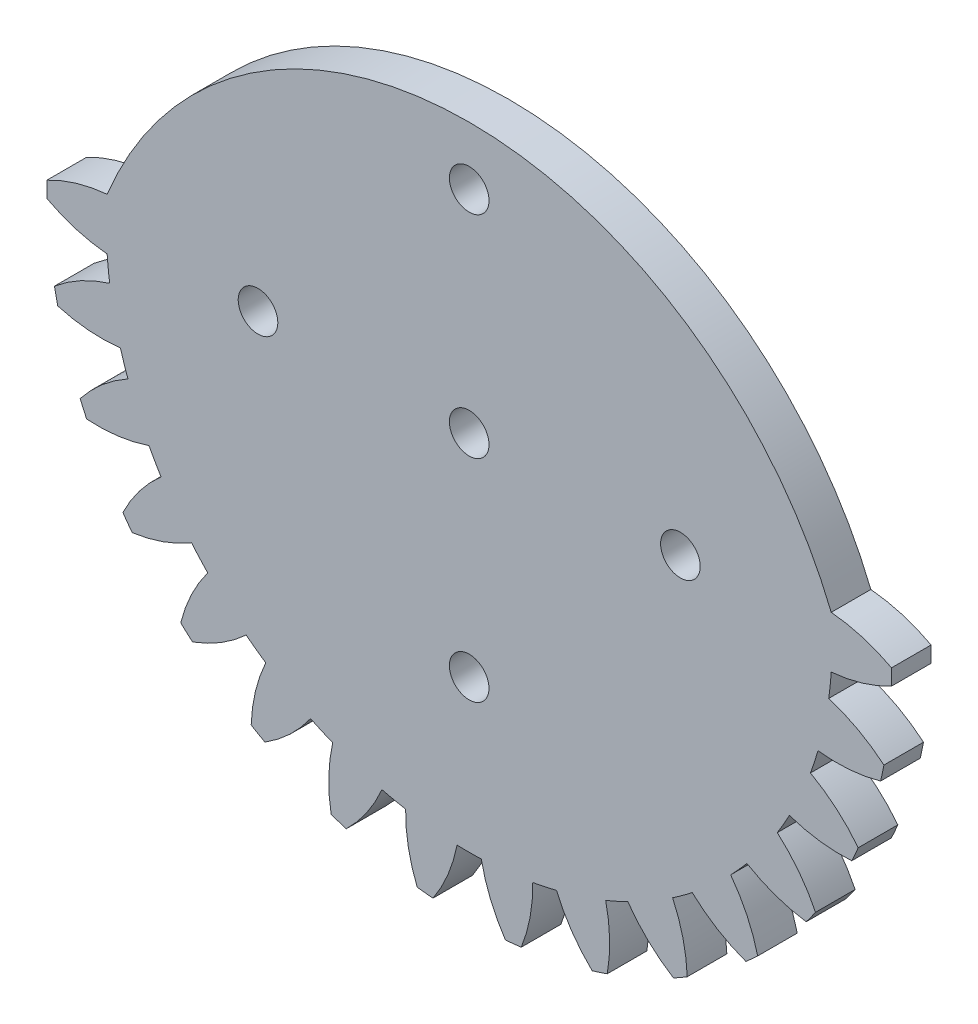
ISO-10303-21;
HEADER;
FILE_DESCRIPTION(('STEP AP214'),'2;1');
FILE_NAME('part.step','',(''),(''),'','','');
FILE_SCHEMA(('AUTOMOTIVE_DESIGN { 1 0 10303 214 1 1 1 1 }'));
ENDSEC;
DATA;
#1=APPLICATION_CONTEXT('core data for automotive mechanical design processes');
#2=APPLICATION_PROTOCOL_DEFINITION('international standard','automotive_design',2000,#1);
#3=PRODUCT_CONTEXT('',#1,'mechanical');
#4=PRODUCT('Part','Part','',(#3));
#5=PRODUCT_RELATED_PRODUCT_CATEGORY('part','',(#4));
#6=PRODUCT_DEFINITION_FORMATION('','',#4);
#7=PRODUCT_DEFINITION_CONTEXT('part definition',#1,'design');
#8=PRODUCT_DEFINITION('design','',#6,#7);
#9=PRODUCT_DEFINITION_SHAPE('','',#8);
#10=(LENGTH_UNIT() NAMED_UNIT(*) SI_UNIT(.MILLI.,.METRE.));
#11=(NAMED_UNIT(*) PLANE_ANGLE_UNIT() SI_UNIT($,.RADIAN.));
#12=(NAMED_UNIT(*) SI_UNIT($,.STERADIAN.) SOLID_ANGLE_UNIT());
#13=UNCERTAINTY_MEASURE_WITH_UNIT(LENGTH_MEASURE(1.E-05),#10,'distance_accuracy_value','');
#14=(GEOMETRIC_REPRESENTATION_CONTEXT(3) GLOBAL_UNCERTAINTY_ASSIGNED_CONTEXT((#13)) GLOBAL_UNIT_ASSIGNED_CONTEXT((#10,
#11,#12)) REPRESENTATION_CONTEXT('',''));
#15=CARTESIAN_POINT('',(0.,0.,0.));
#16=DIRECTION('',(0.,0.,1.));
#17=DIRECTION('',(1.,0.,0.));
#18=AXIS2_PLACEMENT_3D('',#15,#16,#17);
#19=CARTESIAN_POINT('',(-56.7402981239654,51.2081190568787,3.));
#20=DIRECTION('',(0.,0.,-1.));
#21=DIRECTION('',(-1.,0.,0.));
#22=AXIS2_PLACEMENT_3D('',#19,#20,#21);
#23=CYLINDRICAL_SURFACE('',#22,32.);
#24=CARTESIAN_POINT('',(-56.7402981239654,51.2081190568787,0.));
#25=DIRECTION('',(0.,0.,1.));
#26=DIRECTION('',(1.,0.,0.));
#27=AXIS2_PLACEMENT_3D('',#24,#25,#26);
#28=CIRCLE('',#27,32.);
#29=CARTESIAN_POINT('',(-88.7346327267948,51.8102430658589,0.));
#30=VERTEX_POINT('',#29);
#31=CARTESIAN_POINT('',(-88.7346327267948,50.6059950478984,0.));
#32=VERTEX_POINT('',#31);
#33=EDGE_CURVE('E486',#30,#32,#28,.T.);
#34=ORIENTED_EDGE('',*,*,#33,.T.);
#35=DIRECTION('',(0.,0.,-1.));
#36=VECTOR('',#35,1.);
#37=CARTESIAN_POINT('',(-88.7346327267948,50.6059950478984,3.));
#38=LINE('',#37,#36);
#39=CARTESIAN_POINT('',(-88.7346327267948,50.6059950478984,3.));
#40=VERTEX_POINT('',#39);
#41=EDGE_CURVE('E56',#40,#32,#38,.T.);
#42=ORIENTED_EDGE('',*,*,#41,.F.);
#43=CARTESIAN_POINT('',(-56.7402981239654,51.2081190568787,3.));
#44=DIRECTION('',(0.,0.,1.));
#45=DIRECTION('',(1.,0.,0.));
#46=AXIS2_PLACEMENT_3D('',#43,#44,#45);
#47=CIRCLE('',#46,32.);
#48=CARTESIAN_POINT('',(-88.7346327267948,51.8102430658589,3.));
#49=VERTEX_POINT('',#48);
#50=EDGE_CURVE('E613',#49,#40,#47,.T.);
#51=ORIENTED_EDGE('',*,*,#50,.F.);
#52=DIRECTION('',(0.,0.,-1.));
#53=VECTOR('',#52,1.);
#54=CARTESIAN_POINT('',(-88.7346327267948,51.8102430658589,3.));
#55=LINE('',#54,#53);
#56=EDGE_CURVE('E485',#49,#30,#55,.T.);
#57=ORIENTED_EDGE('',*,*,#56,.T.);
#58=EDGE_LOOP('',(#34,#42,#51,#57));
#59=FACE_BOUND('',#58,.T.);
#60=ADVANCED_FACE('F48',(#59),#23,.T.);
#61=CARTESIAN_POINT('',(-83.1004969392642,61.2011125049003,3.));
#62=DIRECTION('',(0.,0.,-1.));
#63=DIRECTION('',(-1.,0.,0.));
#64=AXIS2_PLACEMENT_3D('',#61,#62,#63);
#65=CYLINDRICAL_SURFACE('',#64,12.);
#66=CARTESIAN_POINT('',(-83.1004969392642,61.2011125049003,0.));
#67=DIRECTION('',(0.,0.,1.));
#68=DIRECTION('',(1.,0.,0.));
#69=AXIS2_PLACEMENT_3D('',#66,#67,#68);
#70=CIRCLE('',#69,12.);
#71=CARTESIAN_POINT('',(-84.1694090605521,49.2488145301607,0.));
#72=VERTEX_POINT('',#71);
#73=EDGE_CURVE('E489',#32,#72,#70,.T.);
#74=ORIENTED_EDGE('',*,*,#73,.T.);
#75=DIRECTION('',(0.,0.,-1.));
#76=VECTOR('',#75,1.);
#77=CARTESIAN_POINT('',(-84.1694090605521,49.2488145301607,3.));
#78=LINE('',#77,#76);
#79=CARTESIAN_POINT('',(-84.1694090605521,49.2488145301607,3.));
#80=VERTEX_POINT('',#79);
#81=EDGE_CURVE('E788',#80,#72,#78,.T.);
#82=ORIENTED_EDGE('',*,*,#81,.F.);
#83=CARTESIAN_POINT('',(-83.1004969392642,61.2011125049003,3.));
#84=DIRECTION('',(0.,0.,1.));
#85=DIRECTION('',(1.,0.,0.));
#86=AXIS2_PLACEMENT_3D('',#83,#84,#85);
#87=CIRCLE('',#86,12.);
#88=EDGE_CURVE('E275',#40,#80,#87,.T.);
#89=ORIENTED_EDGE('',*,*,#88,.F.);
#90=ORIENTED_EDGE('',*,*,#41,.T.);
#91=EDGE_LOOP('',(#74,#82,#89,#90));
#92=FACE_BOUND('',#91,.T.);
#93=ADVANCED_FACE('F967',(#92),#65,.T.);
#94=CARTESIAN_POINT('',(-56.7402981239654,51.2081190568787,3.));
#95=DIRECTION('',(0.,0.,-1.));
#96=DIRECTION('',(-1.,0.,0.));
#97=AXIS2_PLACEMENT_3D('',#94,#95,#96);
#98=CYLINDRICAL_SURFACE('',#97,27.499);
#99=CARTESIAN_POINT('',(-56.7402981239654,51.2081190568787,0.));
#100=DIRECTION('',(0.,0.,1.));
#101=DIRECTION('',(1.,0.,0.));
#102=AXIS2_PLACEMENT_3D('',#99,#100,#101);
#103=CIRCLE('',#102,27.499);
#104=CARTESIAN_POINT('',(-83.9773794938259,47.421775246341,0.));
#105=VERTEX_POINT('',#104);
#106=EDGE_CURVE('E492',#72,#105,#103,.T.);
#107=ORIENTED_EDGE('',*,*,#106,.T.);
#108=DIRECTION('',(0.,0.,-1.));
#109=VECTOR('',#108,1.);
#110=CARTESIAN_POINT('',(-83.9773794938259,47.421775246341,3.));
#111=LINE('',#110,#109);
#112=CARTESIAN_POINT('',(-83.9773794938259,47.421775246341,3.));
#113=VERTEX_POINT('',#112);
#114=EDGE_CURVE('E785',#113,#105,#111,.T.);
#115=ORIENTED_EDGE('',*,*,#114,.F.);
#116=CARTESIAN_POINT('',(-56.7402981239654,51.2081190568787,3.));
#117=DIRECTION('',(0.,0.,1.));
#118=DIRECTION('',(1.,0.,0.));
#119=AXIS2_PLACEMENT_3D('',#116,#117,#118);
#120=CIRCLE('',#119,27.499);
#121=EDGE_CURVE('E828',#80,#113,#120,.T.);
#122=ORIENTED_EDGE('',*,*,#121,.F.);
#123=ORIENTED_EDGE('',*,*,#81,.T.);
#124=EDGE_LOOP('',(#107,#115,#122,#123));
#125=FACE_BOUND('',#124,.T.);
#126=ADVANCED_FACE('F969',(#125),#98,.T.);
#127=CARTESIAN_POINT('',(-80.446803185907,35.9529029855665,3.));
#128=DIRECTION('',(0.,0.,-1.));
#129=DIRECTION('',(-1.,0.,0.));
#130=AXIS2_PLACEMENT_3D('',#127,#128,#129);
#131=CYLINDRICAL_SURFACE('',#130,12.);
#132=CARTESIAN_POINT('',(-80.446803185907,35.9529029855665,0.));
#133=DIRECTION('',(0.,0.,1.));
#134=DIRECTION('',(1.,0.,0.));
#135=AXIS2_PLACEMENT_3D('',#132,#133,#134);
#136=CIRCLE('',#135,12.);
#137=CARTESIAN_POINT('',(-88.1606683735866,45.1450890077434,0.));
#138=VERTEX_POINT('',#137);
#139=EDGE_CURVE('E494',#105,#138,#136,.T.);
#140=ORIENTED_EDGE('',*,*,#139,.T.);
#141=DIRECTION('',(0.,0.,-1.));
#142=VECTOR('',#141,1.);
#143=CARTESIAN_POINT('',(-88.1606683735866,45.1450890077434,3.));
#144=LINE('',#143,#142);
#145=CARTESIAN_POINT('',(-88.1606683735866,45.1450890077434,3.));
#146=VERTEX_POINT('',#145);
#147=EDGE_CURVE('E782',#146,#138,#144,.T.);
#148=ORIENTED_EDGE('',*,*,#147,.F.);
#149=CARTESIAN_POINT('',(-80.446803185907,35.9529029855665,3.));
#150=DIRECTION('',(0.,0.,1.));
#151=DIRECTION('',(1.,0.,0.));
#152=AXIS2_PLACEMENT_3D('',#149,#150,#151);
#153=CIRCLE('',#152,12.);
#154=EDGE_CURVE('E830',#113,#146,#153,.T.);
#155=ORIENTED_EDGE('',*,*,#154,.F.);
#156=ORIENTED_EDGE('',*,*,#114,.T.);
#157=EDGE_LOOP('',(#140,#148,#155,#156));
#158=FACE_BOUND('',#157,.T.);
#159=ADVANCED_FACE('F974',(#158),#131,.T.);
#160=CARTESIAN_POINT('',(-56.7402981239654,51.2081190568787,3.));
#161=DIRECTION('',(0.,0.,-1.));
#162=DIRECTION('',(-1.,0.,0.));
#163=AXIS2_PLACEMENT_3D('',#160,#161,#162);
#164=CYLINDRICAL_SURFACE('',#163,32.);
#165=CARTESIAN_POINT('',(-56.7402981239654,51.2081190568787,0.));
#166=DIRECTION('',(0.,0.,1.));
#167=DIRECTION('',(1.,0.,0.));
#168=AXIS2_PLACEMENT_3D('',#165,#166,#167);
#169=CIRCLE('',#168,32.);
#170=CARTESIAN_POINT('',(-87.9102911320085,43.9671566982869,0.));
#171=VERTEX_POINT('',#170);
#172=EDGE_CURVE('E496',#138,#171,#169,.T.);
#173=ORIENTED_EDGE('',*,*,#172,.T.);
#174=DIRECTION('',(0.,0.,-1.));
#175=VECTOR('',#174,1.);
#176=CARTESIAN_POINT('',(-87.9102911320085,43.9671566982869,3.));
#177=LINE('',#176,#175);
#178=CARTESIAN_POINT('',(-87.9102911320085,43.9671566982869,3.));
#179=VERTEX_POINT('',#178);
#180=EDGE_CURVE('E779',#179,#171,#177,.T.);
#181=ORIENTED_EDGE('',*,*,#180,.F.);
#182=CARTESIAN_POINT('',(-56.7402981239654,51.2081190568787,3.));
#183=DIRECTION('',(0.,0.,1.));
#184=DIRECTION('',(1.,0.,0.));
#185=AXIS2_PLACEMENT_3D('',#182,#183,#184);
#186=CIRCLE('',#185,32.);
#187=EDGE_CURVE('E832',#146,#179,#186,.T.);
#188=ORIENTED_EDGE('',*,*,#187,.F.);
#189=ORIENTED_EDGE('',*,*,#147,.T.);
#190=EDGE_LOOP('',(#173,#181,#188,#189));
#191=FACE_BOUND('',#190,.T.);
#192=ADVANCED_FACE('F980',(#191),#164,.T.);
#193=CARTESIAN_POINT('',(-84.602123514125,55.5021481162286,3.));
#194=DIRECTION('',(0.,0.,-1.));
#195=DIRECTION('',(-1.,0.,0.));
#196=AXIS2_PLACEMENT_3D('',#193,#194,#195);
#197=CYLINDRICAL_SURFACE('',#196,12.);
#198=CARTESIAN_POINT('',(-84.602123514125,55.5021481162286,0.));
#199=DIRECTION('',(0.,0.,1.));
#200=DIRECTION('',(1.,0.,0.));
#201=AXIS2_PLACEMENT_3D('',#198,#199,#200);
#202=CIRCLE('',#201,12.);
#203=CARTESIAN_POINT('',(-83.1626548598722,43.588797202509,0.));
#204=VERTEX_POINT('',#203);
#205=EDGE_CURVE('E498',#171,#204,#202,.T.);
#206=ORIENTED_EDGE('',*,*,#205,.T.);
#207=DIRECTION('',(0.,0.,-1.));
#208=VECTOR('',#207,1.);
#209=CARTESIAN_POINT('',(-83.1626548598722,43.588797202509,3.));
#210=LINE('',#209,#208);
#211=CARTESIAN_POINT('',(-83.1626548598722,43.588797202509,3.));
#212=VERTEX_POINT('',#211);
#213=EDGE_CURVE('E776',#212,#204,#210,.T.);
#214=ORIENTED_EDGE('',*,*,#213,.F.);
#215=CARTESIAN_POINT('',(-84.602123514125,55.5021481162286,3.));
#216=DIRECTION('',(0.,0.,1.));
#217=DIRECTION('',(1.,0.,0.));
#218=AXIS2_PLACEMENT_3D('',#215,#216,#217);
#219=CIRCLE('',#218,12.);
#220=EDGE_CURVE('E834',#179,#212,#219,.T.);
#221=ORIENTED_EDGE('',*,*,#220,.F.);
#222=ORIENTED_EDGE('',*,*,#180,.T.);
#223=EDGE_LOOP('',(#206,#214,#221,#222));
#224=FACE_BOUND('',#223,.T.);
#225=ADVANCED_FACE('F984',(#224),#197,.T.);
#226=CARTESIAN_POINT('',(-56.7402981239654,51.2081190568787,3.));
#227=DIRECTION('',(0.,0.,-1.));
#228=DIRECTION('',(-1.,0.,0.));
#229=AXIS2_PLACEMENT_3D('',#226,#227,#228);
#230=CYLINDRICAL_SURFACE('',#229,27.499);
#231=CARTESIAN_POINT('',(-56.7402981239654,51.2081190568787,0.));
#232=DIRECTION('',(0.,0.,1.));
#233=DIRECTION('',(1.,0.,0.));
#234=AXIS2_PLACEMENT_3D('',#231,#232,#233);
#235=CIRCLE('',#234,27.499);
#236=CARTESIAN_POINT('',(-82.5949587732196,41.8416083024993,0.));
#237=VERTEX_POINT('',#236);
#238=EDGE_CURVE('E500',#204,#237,#235,.T.);
#239=ORIENTED_EDGE('',*,*,#238,.T.);
#240=DIRECTION('',(0.,0.,-1.));
#241=VECTOR('',#240,1.);
#242=CARTESIAN_POINT('',(-82.5949587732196,41.8416083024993,3.));
#243=LINE('',#242,#241);
#244=CARTESIAN_POINT('',(-82.5949587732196,41.8416083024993,3.));
#245=VERTEX_POINT('',#244);
#246=EDGE_CURVE('E773',#245,#237,#243,.T.);
#247=ORIENTED_EDGE('',*,*,#246,.F.);
#248=CARTESIAN_POINT('',(-56.7402981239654,51.2081190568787,3.));
#249=DIRECTION('',(0.,0.,1.));
#250=DIRECTION('',(1.,0.,0.));
#251=AXIS2_PLACEMENT_3D('',#248,#249,#250);
#252=CIRCLE('',#251,27.499);
#253=EDGE_CURVE('E836',#212,#245,#252,.T.);
#254=ORIENTED_EDGE('',*,*,#253,.F.);
#255=ORIENTED_EDGE('',*,*,#213,.T.);
#256=EDGE_LOOP('',(#239,#247,#254,#255));
#257=FACE_BOUND('',#256,.T.);
#258=ADVANCED_FACE('F989',(#257),#230,.T.);
#259=CARTESIAN_POINT('',(-76.7570214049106,31.3574065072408,3.));
#260=DIRECTION('',(0.,0.,-1.));
#261=DIRECTION('',(-1.,0.,0.));
#262=AXIS2_PLACEMENT_3D('',#259,#260,#261);
#263=CYLINDRICAL_SURFACE('',#262,12.);
#264=CARTESIAN_POINT('',(-76.7570214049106,31.3574065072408,0.));
#265=DIRECTION('',(0.,0.,1.));
#266=DIRECTION('',(1.,0.,0.));
#267=AXIS2_PLACEMENT_3D('',#264,#265,#266);
#268=CIRCLE('',#267,12.);
#269=CARTESIAN_POINT('',(-86.2134830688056,38.7449184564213,0.));
#270=VERTEX_POINT('',#269);
#271=EDGE_CURVE('E502',#237,#270,#268,.T.);
#272=ORIENTED_EDGE('',*,*,#271,.T.);
#273=DIRECTION('',(0.,0.,-1.));
#274=VECTOR('',#273,1.);
#275=CARTESIAN_POINT('',(-86.2134830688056,38.7449184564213,3.));
#276=LINE('',#275,#274);
#277=CARTESIAN_POINT('',(-86.2134830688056,38.7449184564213,3.));
#278=VERTEX_POINT('',#277);
#279=EDGE_CURVE('E770',#278,#270,#276,.T.);
#280=ORIENTED_EDGE('',*,*,#279,.F.);
#281=CARTESIAN_POINT('',(-76.7570214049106,31.3574065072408,3.));
#282=DIRECTION('',(0.,0.,1.));
#283=DIRECTION('',(1.,0.,0.));
#284=AXIS2_PLACEMENT_3D('',#281,#282,#283);
#285=CIRCLE('',#284,12.);
#286=EDGE_CURVE('E838',#245,#278,#285,.T.);
#287=ORIENTED_EDGE('',*,*,#286,.F.);
#288=ORIENTED_EDGE('',*,*,#246,.T.);
#289=EDGE_LOOP('',(#272,#280,#287,#288));
#290=FACE_BOUND('',#289,.T.);
#291=ADVANCED_FACE('F995',(#290),#263,.T.);
#292=CARTESIAN_POINT('',(-56.7402981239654,51.2081190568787,3.));
#293=DIRECTION('',(0.,0.,-1.));
#294=DIRECTION('',(-1.,0.,0.));
#295=AXIS2_PLACEMENT_3D('',#292,#293,#294);
#296=CYLINDRICAL_SURFACE('',#295,32.);
#297=CARTESIAN_POINT('',(-56.7402981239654,51.2081190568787,0.));
#298=DIRECTION('',(0.,0.,1.));
#299=DIRECTION('',(1.,0.,0.));
#300=AXIS2_PLACEMENT_3D('',#297,#298,#299);
#301=CIRCLE('',#300,32.);
#302=CARTESIAN_POINT('',(-85.7236712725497,37.6447831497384,0.));
#303=VERTEX_POINT('',#302);
#304=EDGE_CURVE('E504',#270,#303,#301,.T.);
#305=ORIENTED_EDGE('',*,*,#304,.T.);
#306=DIRECTION('',(0.,0.,-1.));
#307=VECTOR('',#306,1.);
#308=CARTESIAN_POINT('',(-85.7236712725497,37.6447831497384,3.));
#309=LINE('',#308,#307);
#310=CARTESIAN_POINT('',(-85.7236712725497,37.6447831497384,3.));
#311=VERTEX_POINT('',#310);
#312=EDGE_CURVE('E767',#311,#303,#309,.T.);
#313=ORIENTED_EDGE('',*,*,#312,.F.);
#314=CARTESIAN_POINT('',(-56.7402981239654,51.2081190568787,3.));
#315=DIRECTION('',(0.,0.,1.));
#316=DIRECTION('',(1.,0.,0.));
#317=AXIS2_PLACEMENT_3D('',#314,#315,#316);
#318=CIRCLE('',#317,32.);
#319=EDGE_CURVE('E840',#278,#311,#318,.T.);
#320=ORIENTED_EDGE('',*,*,#319,.F.);
#321=ORIENTED_EDGE('',*,*,#279,.T.);
#322=EDGE_LOOP('',(#305,#313,#320,#321));
#323=FACE_BOUND('',#322,.T.);
#324=ADVANCED_FACE('F999',(#323),#296,.T.);
#325=CARTESIAN_POINT('',(-84.8860546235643,49.6155140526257,3.));
#326=DIRECTION('',(0.,0.,-1.));
#327=DIRECTION('',(-1.,0.,0.));
#328=AXIS2_PLACEMENT_3D('',#325,#326,#327);
#329=CYLINDRICAL_SURFACE('',#328,12.);
#330=CARTESIAN_POINT('',(-84.8860546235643,49.6155140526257,0.));
#331=DIRECTION('',(0.,0.,1.));
#332=DIRECTION('',(1.,0.,0.));
#333=AXIS2_PLACEMENT_3D('',#330,#331,#332);
#334=CIRCLE('',#333,12.);
#335=CARTESIAN_POINT('',(-81.0011168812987,38.2617808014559,0.));
#336=VERTEX_POINT('',#335);
#337=EDGE_CURVE('E506',#303,#336,#334,.T.);
#338=ORIENTED_EDGE('',*,*,#337,.T.);
#339=DIRECTION('',(0.,0.,-1.));
#340=VECTOR('',#339,1.);
#341=CARTESIAN_POINT('',(-81.0011168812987,38.2617808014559,3.));
#342=LINE('',#341,#340);
#343=CARTESIAN_POINT('',(-81.0011168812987,38.2617808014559,3.));
#344=VERTEX_POINT('',#343);
#345=EDGE_CURVE('E764',#344,#336,#342,.T.);
#346=ORIENTED_EDGE('',*,*,#345,.F.);
#347=CARTESIAN_POINT('',(-84.8860546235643,49.6155140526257,3.));
#348=DIRECTION('',(0.,0.,1.));
#349=DIRECTION('',(1.,0.,0.));
#350=AXIS2_PLACEMENT_3D('',#347,#348,#349);
#351=CIRCLE('',#350,12.);
#352=EDGE_CURVE('E842',#311,#344,#351,.T.);
#353=ORIENTED_EDGE('',*,*,#352,.F.);
#354=ORIENTED_EDGE('',*,*,#312,.T.);
#355=EDGE_LOOP('',(#338,#346,#353,#354));
#356=FACE_BOUND('',#355,.T.);
#357=ADVANCED_FACE('F1004',(#356),#329,.T.);
#358=CARTESIAN_POINT('',(-56.7402981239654,51.2081190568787,3.));
#359=DIRECTION('',(0.,0.,-1.));
#360=DIRECTION('',(-1.,0.,0.));
#361=AXIS2_PLACEMENT_3D('',#358,#359,#360);
#362=CYLINDRICAL_SURFACE('',#361,27.499);
#363=CARTESIAN_POINT('',(-56.7402981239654,51.2081190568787,0.));
#364=DIRECTION('',(0.,0.,1.));
#365=DIRECTION('',(1.,0.,0.));
#366=AXIS2_PLACEMENT_3D('',#363,#364,#365);
#367=CIRCLE('',#366,27.499);
#368=CARTESIAN_POINT('',(-80.0825653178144,36.6708028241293,0.));
#369=VERTEX_POINT('',#368);
#370=EDGE_CURVE('E508',#336,#369,#367,.T.);
#371=ORIENTED_EDGE('',*,*,#370,.T.);
#372=DIRECTION('',(0.,0.,-1.));
#373=VECTOR('',#372,1.);
#374=CARTESIAN_POINT('',(-80.0825653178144,36.6708028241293,3.));
#375=LINE('',#374,#373);
#376=CARTESIAN_POINT('',(-80.0825653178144,36.6708028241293,3.));
#377=VERTEX_POINT('',#376);
#378=EDGE_CURVE('E761',#377,#369,#375,.T.);
#379=ORIENTED_EDGE('',*,*,#378,.F.);
#380=CARTESIAN_POINT('',(-56.7402981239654,51.2081190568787,3.));
#381=DIRECTION('',(0.,0.,1.));
#382=DIRECTION('',(1.,0.,0.));
#383=AXIS2_PLACEMENT_3D('',#380,#381,#382);
#384=CIRCLE('',#383,27.499);
#385=EDGE_CURVE('E844',#344,#377,#384,.T.);
#386=ORIENTED_EDGE('',*,*,#385,.F.);
#387=ORIENTED_EDGE('',*,*,#345,.T.);
#388=EDGE_LOOP('',(#371,#379,#386,#387));
#389=FACE_BOUND('',#388,.T.);
#390=ADVANCED_FACE('F1010',(#389),#362,.T.);
#391=CARTESIAN_POINT('',(-72.1924127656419,27.6294814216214,3.));
#392=DIRECTION('',(0.,0.,-1.));
#393=DIRECTION('',(-1.,0.,0.));
#394=AXIS2_PLACEMENT_3D('',#391,#392,#393);
#395=CYLINDRICAL_SURFACE('',#394,12.);
#396=CARTESIAN_POINT('',(-72.1924127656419,27.6294814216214,0.));
#397=DIRECTION('',(0.,0.,1.));
#398=DIRECTION('',(1.,0.,0.));
#399=AXIS2_PLACEMENT_3D('',#396,#397,#398);
#400=CIRCLE('',#399,12.);
#401=CARTESIAN_POINT('',(-82.9781781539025,32.8894495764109,0.));
#402=VERTEX_POINT('',#401);
#403=EDGE_CURVE('E510',#369,#402,#400,.T.);
#404=ORIENTED_EDGE('',*,*,#403,.T.);
#405=DIRECTION('',(0.,0.,-1.));
#406=VECTOR('',#405,1.);
#407=CARTESIAN_POINT('',(-82.9781781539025,32.8894495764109,3.));
#408=LINE('',#407,#406);
#409=CARTESIAN_POINT('',(-82.9781781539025,32.8894495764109,3.));
#410=VERTEX_POINT('',#409);
#411=EDGE_CURVE('E758',#410,#402,#408,.T.);
#412=ORIENTED_EDGE('',*,*,#411,.F.);
#413=CARTESIAN_POINT('',(-72.1924127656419,27.6294814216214,3.));
#414=DIRECTION('',(0.,0.,1.));
#415=DIRECTION('',(1.,0.,0.));
#416=AXIS2_PLACEMENT_3D('',#413,#414,#415);
#417=CIRCLE('',#416,12.);
#418=EDGE_CURVE('E846',#377,#410,#417,.T.);
#419=ORIENTED_EDGE('',*,*,#418,.F.);
#420=ORIENTED_EDGE('',*,*,#378,.T.);
#421=EDGE_LOOP('',(#404,#412,#419,#420));
#422=FACE_BOUND('',#421,.T.);
#423=ADVANCED_FACE('F1014',(#422),#395,.T.);
#424=CARTESIAN_POINT('',(-56.7402981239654,51.2081190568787,3.));
#425=DIRECTION('',(0.,0.,-1.));
#426=DIRECTION('',(-1.,0.,0.));
#427=AXIS2_PLACEMENT_3D('',#424,#425,#426);
#428=CYLINDRICAL_SURFACE('',#427,32.);
#429=CARTESIAN_POINT('',(-56.7402981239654,51.2081190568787,0.));
#430=DIRECTION('',(0.,0.,1.));
#431=DIRECTION('',(1.,0.,0.));
#432=AXIS2_PLACEMENT_3D('',#429,#430,#431);
#433=CIRCLE('',#432,32.);
#434=CARTESIAN_POINT('',(-82.2703389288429,31.9151924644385,0.));
#435=VERTEX_POINT('',#434);
#436=EDGE_CURVE('E512',#402,#435,#433,.T.);
#437=ORIENTED_EDGE('',*,*,#436,.T.);
#438=DIRECTION('',(0.,0.,-1.));
#439=VECTOR('',#438,1.);
#440=CARTESIAN_POINT('',(-82.2703389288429,31.9151924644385,3.));
#441=LINE('',#440,#439);
#442=CARTESIAN_POINT('',(-82.2703389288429,31.9151924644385,3.));
#443=VERTEX_POINT('',#442);
#444=EDGE_CURVE('E755',#443,#435,#441,.T.);
#445=ORIENTED_EDGE('',*,*,#444,.F.);
#446=CARTESIAN_POINT('',(-56.7402981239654,51.2081190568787,3.));
#447=DIRECTION('',(0.,0.,1.));
#448=DIRECTION('',(1.,0.,0.));
#449=AXIS2_PLACEMENT_3D('',#446,#447,#448);
#450=CIRCLE('',#449,32.);
#451=EDGE_CURVE('E848',#410,#443,#450,.T.);
#452=ORIENTED_EDGE('',*,*,#451,.F.);
#453=ORIENTED_EDGE('',*,*,#411,.T.);
#454=EDGE_LOOP('',(#437,#445,#452,#453));
#455=FACE_BOUND('',#454,.T.);
#456=ADVANCED_FACE('F1019',(#455),#428,.T.);
#457=CARTESIAN_POINT('',(-83.9398811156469,43.7984844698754,3.));
#458=DIRECTION('',(0.,0.,-1.));
#459=DIRECTION('',(-1.,0.,0.));
#460=AXIS2_PLACEMENT_3D('',#457,#458,#459);
#461=CYLINDRICAL_SURFACE('',#460,12.);
#462=CARTESIAN_POINT('',(-83.9398811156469,43.7984844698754,0.));
#463=DIRECTION('',(0.,0.,1.));
#464=DIRECTION('',(1.,0.,0.));
#465=AXIS2_PLACEMENT_3D('',#462,#463,#464);
#466=CIRCLE('',#465,12.);
#467=CARTESIAN_POINT('',(-77.779264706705,33.5005815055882,0.));
#468=VERTEX_POINT('',#467);
#469=EDGE_CURVE('E514',#435,#468,#466,.T.);
#470=ORIENTED_EDGE('',*,*,#469,.T.);
#471=DIRECTION('',(0.,0.,-1.));
#472=VECTOR('',#471,1.);
#473=CARTESIAN_POINT('',(-77.779264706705,33.5005815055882,3.));
#474=LINE('',#473,#472);
#475=CARTESIAN_POINT('',(-77.779264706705,33.5005815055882,3.));
#476=VERTEX_POINT('',#475);
#477=EDGE_CURVE('E752',#476,#468,#474,.T.);
#478=ORIENTED_EDGE('',*,*,#477,.F.);
#479=CARTESIAN_POINT('',(-83.9398811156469,43.7984844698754,3.));
#480=DIRECTION('',(0.,0.,1.));
#481=DIRECTION('',(1.,0.,0.));
#482=AXIS2_PLACEMENT_3D('',#479,#480,#481);
#483=CIRCLE('',#482,12.);
#484=EDGE_CURVE('E850',#443,#476,#483,.T.);
#485=ORIENTED_EDGE('',*,*,#484,.F.);
#486=ORIENTED_EDGE('',*,*,#444,.T.);
#487=EDGE_LOOP('',(#470,#478,#485,#486));
#488=FACE_BOUND('',#487,.T.);
#489=ADVANCED_FACE('F1025',(#488),#461,.T.);
#490=CARTESIAN_POINT('',(-56.7402981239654,51.2081190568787,3.));
#491=DIRECTION('',(0.,0.,-1.));
#492=DIRECTION('',(-1.,0.,0.));
#493=AXIS2_PLACEMENT_3D('',#490,#491,#492);
#494=CYLINDRICAL_SURFACE('',#493,27.499);
#495=CARTESIAN_POINT('',(-56.7402981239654,51.2081190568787,0.));
#496=DIRECTION('',(0.,0.,1.));
#497=DIRECTION('',(1.,0.,0.));
#498=AXIS2_PLACEMENT_3D('',#495,#496,#497);
#499=CIRCLE('',#498,27.499);
#500=CARTESIAN_POINT('',(-76.5500027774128,32.1353478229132,0.));
#501=VERTEX_POINT('',#500);
#502=EDGE_CURVE('E516',#468,#501,#499,.T.);
#503=ORIENTED_EDGE('',*,*,#502,.T.);
#504=DIRECTION('',(0.,0.,-1.));
#505=VECTOR('',#504,1.);
#506=CARTESIAN_POINT('',(-76.5500027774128,32.1353478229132,3.));
#507=LINE('',#506,#505);
#508=CARTESIAN_POINT('',(-76.5500027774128,32.1353478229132,3.));
#509=VERTEX_POINT('',#508);
#510=EDGE_CURVE('E749',#509,#501,#507,.T.);
#511=ORIENTED_EDGE('',*,*,#510,.F.);
#512=CARTESIAN_POINT('',(-56.7402981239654,51.2081190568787,3.));
#513=DIRECTION('',(0.,0.,1.));
#514=DIRECTION('',(1.,0.,0.));
#515=AXIS2_PLACEMENT_3D('',#512,#513,#514);
#516=CIRCLE('',#515,27.499);
#517=EDGE_CURVE('E852',#476,#509,#516,.T.);
#518=ORIENTED_EDGE('',*,*,#517,.F.);
#519=ORIENTED_EDGE('',*,*,#477,.T.);
#520=EDGE_LOOP('',(#503,#511,#518,#519));
#521=FACE_BOUND('',#520,.T.);
#522=ADVANCED_FACE('F1029',(#521),#494,.T.);
#523=CARTESIAN_POINT('',(-66.9524725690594,24.9320559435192,3.));
#524=DIRECTION('',(0.,0.,-1.));
#525=DIRECTION('',(-1.,0.,0.));
#526=AXIS2_PLACEMENT_3D('',#523,#524,#525);
#527=CYLINDRICAL_SURFACE('',#526,12.);
#528=CARTESIAN_POINT('',(-66.9524725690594,24.9320559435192,0.));
#529=DIRECTION('',(0.,0.,1.));
#530=DIRECTION('',(1.,0.,0.));
#531=AXIS2_PLACEMENT_3D('',#528,#529,#530);
#532=CIRCLE('',#531,12.);
#533=CARTESIAN_POINT('',(-78.5961519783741,27.8345944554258,0.));
#534=VERTEX_POINT('',#533);
#535=EDGE_CURVE('E518',#501,#534,#532,.T.);
#536=ORIENTED_EDGE('',*,*,#535,.T.);
#537=DIRECTION('',(0.,0.,-1.));
#538=VECTOR('',#537,1.);
#539=CARTESIAN_POINT('',(-78.5961519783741,27.8345944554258,3.));
#540=LINE('',#539,#538);
#541=CARTESIAN_POINT('',(-78.5961519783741,27.8345944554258,3.));
#542=VERTEX_POINT('',#541);
#543=EDGE_CURVE('E746',#542,#534,#540,.T.);
#544=ORIENTED_EDGE('',*,*,#543,.F.);
#545=CARTESIAN_POINT('',(-66.9524725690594,24.9320559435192,3.));
#546=DIRECTION('',(0.,0.,1.));
#547=DIRECTION('',(1.,0.,0.));
#548=AXIS2_PLACEMENT_3D('',#545,#546,#547);
#549=CIRCLE('',#548,12.);
#550=EDGE_CURVE('E854',#509,#542,#549,.T.);
#551=ORIENTED_EDGE('',*,*,#550,.F.);
#552=ORIENTED_EDGE('',*,*,#510,.T.);
#553=EDGE_LOOP('',(#536,#544,#551,#552));
#554=FACE_BOUND('',#553,.T.);
#555=ADVANCED_FACE('F1034',(#554),#527,.T.);
#556=CARTESIAN_POINT('',(-56.7402981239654,51.2081190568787,3.));
#557=DIRECTION('',(0.,0.,-1.));
#558=DIRECTION('',(-1.,0.,0.));
#559=AXIS2_PLACEMENT_3D('',#556,#557,#558);
#560=CYLINDRICAL_SURFACE('',#559,32.);
#561=CARTESIAN_POINT('',(-56.7402981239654,51.2081190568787,0.));
#562=DIRECTION('',(0.,0.,1.));
#563=DIRECTION('',(1.,0.,0.));
#564=AXIS2_PLACEMENT_3D('',#561,#562,#563);
#565=CIRCLE('',#564,32.);
#566=CARTESIAN_POINT('',(-77.7012212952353,27.0287952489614,0.));
#567=VERTEX_POINT('',#566);
#568=EDGE_CURVE('E520',#534,#567,#565,.T.);
#569=ORIENTED_EDGE('',*,*,#568,.T.);
#570=DIRECTION('',(0.,0.,-1.));
#571=VECTOR('',#570,1.);
#572=CARTESIAN_POINT('',(-77.7012212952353,27.0287952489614,3.));
#573=LINE('',#572,#571);
#574=CARTESIAN_POINT('',(-77.7012212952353,27.0287952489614,3.));
#575=VERTEX_POINT('',#574);
#576=EDGE_CURVE('E743',#575,#567,#573,.T.);
#577=ORIENTED_EDGE('',*,*,#576,.F.);
#578=CARTESIAN_POINT('',(-56.7402981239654,51.2081190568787,3.));
#579=DIRECTION('',(0.,0.,1.));
#580=DIRECTION('',(1.,0.,0.));
#581=AXIS2_PLACEMENT_3D('',#578,#579,#580);
#582=CIRCLE('',#581,32.);
#583=EDGE_CURVE('E856',#542,#575,#582,.T.);
#584=ORIENTED_EDGE('',*,*,#583,.F.);
#585=ORIENTED_EDGE('',*,*,#543,.T.);
#586=EDGE_LOOP('',(#569,#577,#584,#585));
#587=FACE_BOUND('',#586,.T.);
#588=ADVANCED_FACE('F1040',(#587),#560,.T.);
#589=CARTESIAN_POINT('',(-81.8049553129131,38.3052914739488,3.));
#590=DIRECTION('',(0.,0.,-1.));
#591=DIRECTION('',(-1.,0.,0.));
#592=AXIS2_PLACEMENT_3D('',#589,#590,#591);
#593=CYLINDRICAL_SURFACE('',#592,12.);
#594=CARTESIAN_POINT('',(-81.8049553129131,38.3052914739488,0.));
#595=DIRECTION('',(0.,0.,1.));
#596=DIRECTION('',(1.,0.,0.));
#597=AXIS2_PLACEMENT_3D('',#594,#595,#596);
#598=CIRCLE('',#597,12.);
#599=CARTESIAN_POINT('',(-73.6379087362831,29.5132865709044,0.));
#600=VERTEX_POINT('',#599);
#601=EDGE_CURVE('E522',#567,#600,#598,.T.);
#602=ORIENTED_EDGE('',*,*,#601,.T.);
#603=DIRECTION('',(0.,0.,-1.));
#604=VECTOR('',#603,1.);
#605=CARTESIAN_POINT('',(-73.6379087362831,29.5132865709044,3.));
#606=LINE('',#605,#604);
#607=CARTESIAN_POINT('',(-73.6379087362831,29.5132865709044,3.));
#608=VERTEX_POINT('',#607);
#609=EDGE_CURVE('E740',#608,#600,#606,.T.);
#610=ORIENTED_EDGE('',*,*,#609,.F.);
#611=CARTESIAN_POINT('',(-81.8049553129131,38.3052914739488,3.));
#612=DIRECTION('',(0.,0.,1.));
#613=DIRECTION('',(1.,0.,0.));
#614=AXIS2_PLACEMENT_3D('',#611,#612,#613);
#615=CIRCLE('',#614,12.);
#616=EDGE_CURVE('E858',#575,#608,#615,.T.);
#617=ORIENTED_EDGE('',*,*,#616,.F.);
#618=ORIENTED_EDGE('',*,*,#576,.T.);
#619=EDGE_LOOP('',(#602,#610,#617,#618));
#620=FACE_BOUND('',#619,.T.);
#621=ADVANCED_FACE('F1044',(#620),#593,.T.);
#622=CARTESIAN_POINT('',(-56.7402981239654,51.2081190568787,3.));
#623=DIRECTION('',(0.,0.,-1.));
#624=DIRECTION('',(-1.,0.,0.));
#625=AXIS2_PLACEMENT_3D('',#622,#623,#624);
#626=CYLINDRICAL_SURFACE('',#625,27.499);
#627=CARTESIAN_POINT('',(-56.7402981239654,51.2081190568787,0.));
#628=DIRECTION('',(0.,0.,1.));
#629=DIRECTION('',(1.,0.,0.));
#630=AXIS2_PLACEMENT_3D('',#627,#628,#629);
#631=CIRCLE('',#630,27.499);
#632=CARTESIAN_POINT('',(-72.1516610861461,28.4334644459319,0.));
#633=VERTEX_POINT('',#632);
#634=EDGE_CURVE('E524',#600,#633,#631,.T.);
#635=ORIENTED_EDGE('',*,*,#634,.T.);
#636=DIRECTION('',(0.,0.,-1.));
#637=VECTOR('',#636,1.);
#638=CARTESIAN_POINT('',(-72.1516610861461,28.4334644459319,3.));
#639=LINE('',#638,#637);
#640=CARTESIAN_POINT('',(-72.1516610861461,28.4334644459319,3.));
#641=VERTEX_POINT('',#640);
#642=EDGE_CURVE('E737',#641,#633,#639,.T.);
#643=ORIENTED_EDGE('',*,*,#642,.F.);
#644=CARTESIAN_POINT('',(-56.7402981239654,51.2081190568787,3.));
#645=DIRECTION('',(0.,0.,1.));
#646=DIRECTION('',(1.,0.,0.));
#647=AXIS2_PLACEMENT_3D('',#644,#645,#646);
#648=CIRCLE('',#647,27.499);
#649=EDGE_CURVE('E860',#608,#641,#648,.T.);
#650=ORIENTED_EDGE('',*,*,#649,.F.);
#651=ORIENTED_EDGE('',*,*,#609,.T.);
#652=EDGE_LOOP('',(#635,#643,#650,#651));
#653=FACE_BOUND('',#652,.T.);
#654=ADVANCED_FACE('F1049',(#653),#626,.T.);
#655=CARTESIAN_POINT('',(-61.2662113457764,23.3830205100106,3.));
#656=DIRECTION('',(0.,0.,-1.));
#657=DIRECTION('',(-1.,0.,0.));
#658=AXIS2_PLACEMENT_3D('',#655,#656,#657);
#659=CYLINDRICAL_SURFACE('',#658,12.);
#660=CARTESIAN_POINT('',(-61.2662113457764,23.3830205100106,0.));
#661=DIRECTION('',(0.,0.,1.));
#662=DIRECTION('',(1.,0.,0.));
#663=AXIS2_PLACEMENT_3D('',#660,#661,#662);
#664=CIRCLE('',#663,12.);
#665=CARTESIAN_POINT('',(-73.2589201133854,23.801274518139,0.));
#666=VERTEX_POINT('',#665);
#667=EDGE_CURVE('E526',#633,#666,#664,.T.);
#668=ORIENTED_EDGE('',*,*,#667,.T.);
#669=DIRECTION('',(0.,0.,-1.));
#670=VECTOR('',#669,1.);
#671=CARTESIAN_POINT('',(-73.2589201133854,23.801274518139,3.));
#672=LINE('',#671,#670);
#673=CARTESIAN_POINT('',(-73.2589201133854,23.801274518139,3.));
#674=VERTEX_POINT('',#673);
#675=EDGE_CURVE('E734',#674,#666,#672,.T.);
#676=ORIENTED_EDGE('',*,*,#675,.F.);
#677=CARTESIAN_POINT('',(-61.2662113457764,23.3830205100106,3.));
#678=DIRECTION('',(0.,0.,1.));
#679=DIRECTION('',(1.,0.,0.));
#680=AXIS2_PLACEMENT_3D('',#677,#678,#679);
#681=CIRCLE('',#680,12.);
#682=EDGE_CURVE('E862',#641,#674,#681,.T.);
#683=ORIENTED_EDGE('',*,*,#682,.F.);
#684=ORIENTED_EDGE('',*,*,#642,.T.);
#685=EDGE_LOOP('',(#668,#676,#683,#684));
#686=FACE_BOUND('',#685,.T.);
#687=ADVANCED_FACE('F1055',(#686),#659,.T.);
#688=CARTESIAN_POINT('',(-56.7402981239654,51.2081190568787,3.));
#689=DIRECTION('',(0.,0.,-1.));
#690=DIRECTION('',(-1.,0.,0.));
#691=AXIS2_PLACEMENT_3D('',#688,#689,#690);
#692=CYLINDRICAL_SURFACE('',#691,32.);
#693=CARTESIAN_POINT('',(-56.7402981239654,51.2081190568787,0.));
#694=DIRECTION('',(0.,0.,1.));
#695=DIRECTION('',(1.,0.,0.));
#696=AXIS2_PLACEMENT_3D('',#693,#694,#695);
#697=CIRCLE('',#696,32.);
#698=CARTESIAN_POINT('',(-72.2160107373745,23.1991505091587,0.));
#699=VERTEX_POINT('',#698);
#700=EDGE_CURVE('E528',#666,#699,#697,.T.);
#701=ORIENTED_EDGE('',*,*,#700,.T.);
#702=DIRECTION('',(0.,0.,-1.));
#703=VECTOR('',#702,1.);
#704=CARTESIAN_POINT('',(-72.2160107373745,23.1991505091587,3.));
#705=LINE('',#704,#703);
#706=CARTESIAN_POINT('',(-72.2160107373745,23.1991505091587,3.));
#707=VERTEX_POINT('',#706);
#708=EDGE_CURVE('E731',#707,#699,#705,.T.);
#709=ORIENTED_EDGE('',*,*,#708,.F.);
#710=CARTESIAN_POINT('',(-56.7402981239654,51.2081190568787,3.));
#711=DIRECTION('',(0.,0.,1.));
#712=DIRECTION('',(1.,0.,0.));
#713=AXIS2_PLACEMENT_3D('',#710,#711,#712);
#714=CIRCLE('',#713,32.);
#715=EDGE_CURVE('E864',#674,#707,#714,.T.);
#716=ORIENTED_EDGE('',*,*,#715,.F.);
#717=ORIENTED_EDGE('',*,*,#675,.T.);
#718=EDGE_LOOP('',(#701,#709,#716,#717));
#719=FACE_BOUND('',#718,.T.);
#720=ADVANCED_FACE('F1059',(#719),#692,.T.);
#721=CARTESIAN_POINT('',(-78.5745837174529,33.3760139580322,3.));
#722=DIRECTION('',(0.,0.,-1.));
#723=DIRECTION('',(-1.,0.,0.));
#724=AXIS2_PLACEMENT_3D('',#721,#722,#723);
#725=CYLINDRICAL_SURFACE('',#724,12.);
#726=CARTESIAN_POINT('',(-78.5745837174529,33.3760139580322,0.));
#727=DIRECTION('',(0.,0.,1.));
#728=DIRECTION('',(1.,0.,0.));
#729=AXIS2_PLACEMENT_3D('',#726,#727,#728);
#730=CIRCLE('',#729,12.);
#731=CARTESIAN_POINT('',(-68.758046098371,26.474159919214,0.));
#732=VERTEX_POINT('',#731);
#733=EDGE_CURVE('E530',#699,#732,#730,.T.);
#734=ORIENTED_EDGE('',*,*,#733,.T.);
#735=DIRECTION('',(0.,0.,-1.));
#736=VECTOR('',#735,1.);
#737=CARTESIAN_POINT('',(-68.758046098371,26.474159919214,3.));
#738=LINE('',#737,#736);
#739=CARTESIAN_POINT('',(-68.758046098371,26.474159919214,3.));
#740=VERTEX_POINT('',#739);
#741=EDGE_CURVE('E728',#740,#732,#738,.T.);
#742=ORIENTED_EDGE('',*,*,#741,.F.);
#743=CARTESIAN_POINT('',(-78.5745837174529,33.3760139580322,3.));
#744=DIRECTION('',(0.,0.,1.));
#745=DIRECTION('',(1.,0.,0.));
#746=AXIS2_PLACEMENT_3D('',#743,#744,#745);
#747=CIRCLE('',#746,12.);
#748=EDGE_CURVE('E866',#707,#740,#747,.T.);
#749=ORIENTED_EDGE('',*,*,#748,.F.);
#750=ORIENTED_EDGE('',*,*,#708,.T.);
#751=EDGE_LOOP('',(#734,#742,#749,#750));
#752=FACE_BOUND('',#751,.T.);
#753=ADVANCED_FACE('F1064',(#752),#725,.T.);
#754=CARTESIAN_POINT('',(-56.7402981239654,51.2081190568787,3.));
#755=DIRECTION('',(0.,0.,-1.));
#756=DIRECTION('',(-1.,0.,0.));
#757=AXIS2_PLACEMENT_3D('',#754,#755,#756);
#758=CYLINDRICAL_SURFACE('',#757,27.499);
#759=CARTESIAN_POINT('',(-56.7402981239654,51.2081190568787,0.));
#760=DIRECTION('',(0.,0.,1.));
#761=DIRECTION('',(1.,0.,0.));
#762=AXIS2_PLACEMENT_3D('',#759,#760,#761);
#763=CIRCLE('',#762,27.499);
#764=CARTESIAN_POINT('',(-67.0797688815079,25.7269427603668,0.));
#765=VERTEX_POINT('',#764);
#766=EDGE_CURVE('E532',#732,#765,#763,.T.);
#767=ORIENTED_EDGE('',*,*,#766,.T.);
#768=DIRECTION('',(0.,0.,-1.));
#769=VECTOR('',#768,1.);
#770=CARTESIAN_POINT('',(-67.0797688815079,25.7269427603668,3.));
#771=LINE('',#770,#769);
#772=CARTESIAN_POINT('',(-67.0797688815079,25.7269427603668,3.));
#773=VERTEX_POINT('',#772);
#774=EDGE_CURVE('E725',#773,#765,#771,.T.);
#775=ORIENTED_EDGE('',*,*,#774,.F.);
#776=CARTESIAN_POINT('',(-56.7402981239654,51.2081190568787,3.));
#777=DIRECTION('',(0.,0.,1.));
#778=DIRECTION('',(1.,0.,0.));
#779=AXIS2_PLACEMENT_3D('',#776,#777,#778);
#780=CIRCLE('',#779,27.499);
#781=EDGE_CURVE('E868',#740,#773,#780,.T.);
#782=ORIENTED_EDGE('',*,*,#781,.F.);
#783=ORIENTED_EDGE('',*,*,#741,.T.);
#784=EDGE_LOOP('',(#767,#775,#782,#783));
#785=FACE_BOUND('',#784,.T.);
#786=ADVANCED_FACE('F1070',(#785),#758,.T.);
#787=CARTESIAN_POINT('',(-55.3821459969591,23.0500754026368,3.));
#788=DIRECTION('',(0.,0.,-1.));
#789=DIRECTION('',(-1.,0.,0.));
#790=AXIS2_PLACEMENT_3D('',#787,#788,#789);
#791=CYLINDRICAL_SURFACE('',#790,12.);
#792=CARTESIAN_POINT('',(-55.3821459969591,23.0500754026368,0.));
#793=DIRECTION('',(0.,0.,1.));
#794=DIRECTION('',(1.,0.,0.));
#795=AXIS2_PLACEMENT_3D('',#792,#793,#794);
#796=CIRCLE('',#795,12.);
#797=CARTESIAN_POINT('',(-67.1997452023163,20.9657651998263,0.));
#798=VERTEX_POINT('',#797);
#799=EDGE_CURVE('E534',#765,#798,#796,.T.);
#800=ORIENTED_EDGE('',*,*,#799,.T.);
#801=DIRECTION('',(0.,0.,-1.));
#802=VECTOR('',#801,1.);
#803=CARTESIAN_POINT('',(-67.1997452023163,20.9657651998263,3.));
#804=LINE('',#803,#802);
#805=CARTESIAN_POINT('',(-67.1997452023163,20.9657651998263,3.));
#806=VERTEX_POINT('',#805);
#807=EDGE_CURVE('E722',#806,#798,#804,.T.);
#808=ORIENTED_EDGE('',*,*,#807,.F.);
#809=CARTESIAN_POINT('',(-55.3821459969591,23.0500754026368,3.));
#810=DIRECTION('',(0.,0.,1.));
#811=DIRECTION('',(1.,0.,0.));
#812=AXIS2_PLACEMENT_3D('',#809,#810,#811);
#813=CIRCLE('',#812,12.);
#814=EDGE_CURVE('E870',#773,#806,#813,.T.);
#815=ORIENTED_EDGE('',*,*,#814,.F.);
#816=ORIENTED_EDGE('',*,*,#774,.T.);
#817=EDGE_LOOP('',(#800,#808,#815,#816));
#818=FACE_BOUND('',#817,.T.);
#819=ADVANCED_FACE('F1074',(#818),#791,.T.);
#820=CARTESIAN_POINT('',(-56.7402981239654,51.2081190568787,3.));
#821=DIRECTION('',(0.,0.,-1.));
#822=DIRECTION('',(-1.,0.,0.));
#823=AXIS2_PLACEMENT_3D('',#820,#821,#822);
#824=CYLINDRICAL_SURFACE('',#823,32.);
#825=CARTESIAN_POINT('',(-56.7402981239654,51.2081190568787,0.));
#826=DIRECTION('',(0.,0.,1.));
#827=DIRECTION('',(1.,0.,0.));
#828=AXIS2_PLACEMENT_3D('',#825,#826,#827);
#829=CIRCLE('',#828,32.);
#830=CARTESIAN_POINT('',(-66.0544372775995,20.5936320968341,0.));
#831=VERTEX_POINT('',#830);
#832=EDGE_CURVE('E536',#798,#831,#829,.T.);
#833=ORIENTED_EDGE('',*,*,#832,.T.);
#834=DIRECTION('',(0.,0.,-1.));
#835=VECTOR('',#834,1.);
#836=CARTESIAN_POINT('',(-66.0544372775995,20.5936320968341,3.));
#837=LINE('',#836,#835);
#838=CARTESIAN_POINT('',(-66.0544372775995,20.5936320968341,3.));
#839=VERTEX_POINT('',#838);
#840=EDGE_CURVE('E719',#839,#831,#837,.T.);
#841=ORIENTED_EDGE('',*,*,#840,.F.);
#842=CARTESIAN_POINT('',(-56.7402981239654,51.2081190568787,3.));
#843=DIRECTION('',(0.,0.,1.));
#844=DIRECTION('',(1.,0.,0.));
#845=AXIS2_PLACEMENT_3D('',#842,#843,#844);
#846=CIRCLE('',#845,32.);
#847=EDGE_CURVE('E872',#806,#839,#846,.T.);
#848=ORIENTED_EDGE('',*,*,#847,.F.);
#849=ORIENTED_EDGE('',*,*,#807,.T.);
#850=EDGE_LOOP('',(#833,#841,#848,#849));
#851=FACE_BOUND('',#850,.T.);
#852=ADVANCED_FACE('F1079',(#851),#824,.T.);
#853=CARTESIAN_POINT('',(-74.3899490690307,29.2260850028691,3.));
#854=DIRECTION('',(0.,0.,-1.));
#855=DIRECTION('',(-1.,0.,0.));
#856=AXIS2_PLACEMENT_3D('',#853,#854,#855);
#857=CYLINDRICAL_SURFACE('',#856,12.);
#858=CARTESIAN_POINT('',(-74.3899490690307,29.2260850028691,0.));
#859=DIRECTION('',(0.,0.,1.));
#860=DIRECTION('',(1.,0.,0.));
#861=AXIS2_PLACEMENT_3D('',#858,#859,#860);
#862=CIRCLE('',#861,12.);
#863=CARTESIAN_POINT('',(-63.3529502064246,24.5160259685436,0.));
#864=VERTEX_POINT('',#863);
#865=EDGE_CURVE('E538',#831,#864,#862,.T.);
#866=ORIENTED_EDGE('',*,*,#865,.T.);
#867=DIRECTION('',(0.,0.,-1.));
#868=VECTOR('',#867,1.);
#869=CARTESIAN_POINT('',(-63.3529502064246,24.5160259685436,3.));
#870=LINE('',#869,#868);
#871=CARTESIAN_POINT('',(-63.3529502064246,24.5160259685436,3.));
#872=VERTEX_POINT('',#871);
#873=EDGE_CURVE('E716',#872,#864,#870,.T.);
#874=ORIENTED_EDGE('',*,*,#873,.F.);
#875=CARTESIAN_POINT('',(-74.3899490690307,29.2260850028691,3.));
#876=DIRECTION('',(0.,0.,1.));
#877=DIRECTION('',(1.,0.,0.));
#878=AXIS2_PLACEMENT_3D('',#875,#876,#877);
#879=CIRCLE('',#878,12.);
#880=EDGE_CURVE('E874',#839,#872,#879,.T.);
#881=ORIENTED_EDGE('',*,*,#880,.F.);
#882=ORIENTED_EDGE('',*,*,#840,.T.);
#883=EDGE_LOOP('',(#866,#874,#881,#882));
#884=FACE_BOUND('',#883,.T.);
#885=ADVANCED_FACE('F1085',(#884),#857,.T.);
#886=CARTESIAN_POINT('',(-56.7402981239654,51.2081190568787,3.));
#887=DIRECTION('',(0.,0.,-1.));
#888=DIRECTION('',(-1.,0.,0.));
#889=AXIS2_PLACEMENT_3D('',#886,#887,#888);
#890=CYLINDRICAL_SURFACE('',#889,27.499);
#891=CARTESIAN_POINT('',(-56.7402981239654,51.2081190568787,0.));
#892=DIRECTION('',(0.,0.,1.));
#893=DIRECTION('',(1.,0.,0.));
#894=AXIS2_PLACEMENT_3D('',#891,#892,#893);
#895=CIRCLE('',#894,27.499);
#896=CARTESIAN_POINT('',(-61.5559921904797,24.134070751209,0.));
#897=VERTEX_POINT('',#896);
#898=EDGE_CURVE('E540',#864,#897,#895,.T.);
#899=ORIENTED_EDGE('',*,*,#898,.T.);
#900=DIRECTION('',(0.,0.,-1.));
#901=VECTOR('',#900,1.);
#902=CARTESIAN_POINT('',(-61.5559921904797,24.134070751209,3.));
#903=LINE('',#902,#901);
#904=CARTESIAN_POINT('',(-61.5559921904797,24.134070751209,3.));
#905=VERTEX_POINT('',#904);
#906=EDGE_CURVE('E713',#905,#897,#903,.T.);
#907=ORIENTED_EDGE('',*,*,#906,.F.);
#908=CARTESIAN_POINT('',(-56.7402981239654,51.2081190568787,3.));
#909=DIRECTION('',(0.,0.,1.));
#910=DIRECTION('',(1.,0.,0.));
#911=AXIS2_PLACEMENT_3D('',#908,#909,#910);
#912=CIRCLE('',#911,27.499);
#913=EDGE_CURVE('E876',#872,#905,#912,.T.);
#914=ORIENTED_EDGE('',*,*,#913,.F.);
#915=ORIENTED_EDGE('',*,*,#873,.T.);
#916=EDGE_LOOP('',(#899,#907,#914,#915));
#917=FACE_BOUND('',#916,.T.);
#918=ADVANCED_FACE('F1089',(#917),#890,.T.);
#919=CARTESIAN_POINT('',(-49.5574384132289,23.9477719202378,3.));
#920=DIRECTION('',(0.,0.,-1.));
#921=DIRECTION('',(-1.,0.,0.));
#922=AXIS2_PLACEMENT_3D('',#919,#920,#921);
#923=CYLINDRICAL_SURFACE('',#922,12.);
#924=CARTESIAN_POINT('',(-49.5574384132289,23.9477719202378,0.));
#925=DIRECTION('',(0.,0.,1.));
#926=DIRECTION('',(1.,0.,0.));
#927=AXIS2_PLACEMENT_3D('',#924,#925,#926);
#928=CIRCLE('',#927,12.);
#929=CARTESIAN_POINT('',(-60.6834422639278,19.4519918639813,0.));
#930=VERTEX_POINT('',#929);
#931=EDGE_CURVE('E542',#897,#930,#928,.T.);
#932=ORIENTED_EDGE('',*,*,#931,.T.);
#933=DIRECTION('',(0.,0.,-1.));
#934=VECTOR('',#933,1.);
#935=CARTESIAN_POINT('',(-60.6834422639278,19.4519918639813,3.));
#936=LINE('',#935,#934);
#937=CARTESIAN_POINT('',(-60.6834422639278,19.4519918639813,3.));
#938=VERTEX_POINT('',#937);
#939=EDGE_CURVE('E710',#938,#930,#936,.T.);
#940=ORIENTED_EDGE('',*,*,#939,.F.);
#941=CARTESIAN_POINT('',(-49.5574384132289,23.9477719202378,3.));
#942=DIRECTION('',(0.,0.,1.));
#943=DIRECTION('',(1.,0.,0.));
#944=AXIS2_PLACEMENT_3D('',#941,#942,#943);
#945=CIRCLE('',#944,12.);
#946=EDGE_CURVE('E878',#905,#938,#945,.T.);
#947=ORIENTED_EDGE('',*,*,#946,.F.);
#948=ORIENTED_EDGE('',*,*,#906,.T.);
#949=EDGE_LOOP('',(#932,#940,#947,#948));
#950=FACE_BOUND('',#949,.T.);
#951=ADVANCED_FACE('F1094',(#950),#923,.T.);
#952=CARTESIAN_POINT('',(-56.7402981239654,51.2081190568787,3.));
#953=DIRECTION('',(0.,0.,-1.));
#954=DIRECTION('',(-1.,0.,0.));
#955=AXIS2_PLACEMENT_3D('',#952,#953,#954);
#956=CYLINDRICAL_SURFACE('',#955,32.);
#957=CARTESIAN_POINT('',(-56.7402981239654,51.2081190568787,0.));
#958=DIRECTION('',(0.,0.,1.));
#959=DIRECTION('',(1.,0.,0.));
#960=AXIS2_PLACEMENT_3D('',#957,#958,#959);
#961=CIRCLE('',#960,32.);
#962=CARTESIAN_POINT('',(-59.4857912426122,19.3261136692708,0.));
#963=VERTEX_POINT('',#962);
#964=EDGE_CURVE('E544',#930,#963,#961,.T.);
#965=ORIENTED_EDGE('',*,*,#964,.T.);
#966=DIRECTION('',(0.,0.,-1.));
#967=VECTOR('',#966,1.);
#968=CARTESIAN_POINT('',(-59.4857912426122,19.3261136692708,3.));
#969=LINE('',#968,#967);
#970=CARTESIAN_POINT('',(-59.4857912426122,19.3261136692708,3.));
#971=VERTEX_POINT('',#970);
#972=EDGE_CURVE('E707',#971,#963,#969,.T.);
#973=ORIENTED_EDGE('',*,*,#972,.F.);
#974=CARTESIAN_POINT('',(-56.7402981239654,51.2081190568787,3.));
#975=DIRECTION('',(0.,0.,1.));
#976=DIRECTION('',(1.,0.,0.));
#977=AXIS2_PLACEMENT_3D('',#974,#975,#976);
#978=CIRCLE('',#977,32.);
#979=EDGE_CURVE('E880',#938,#971,#978,.T.);
#980=ORIENTED_EDGE('',*,*,#979,.F.);
#981=ORIENTED_EDGE('',*,*,#939,.T.);
#982=EDGE_LOOP('',(#965,#973,#980,#981));
#983=FACE_BOUND('',#982,.T.);
#984=ADVANCED_FACE('F1100',(#983),#956,.T.);
#985=CARTESIAN_POINT('',(-69.4339399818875,26.0368764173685,3.));
#986=DIRECTION('',(0.,0.,-1.));
#987=DIRECTION('',(-1.,0.,0.));
#988=AXIS2_PLACEMENT_3D('',#985,#986,#987);
#989=CYLINDRICAL_SURFACE('',#988,12.);
#990=CARTESIAN_POINT('',(-69.4339399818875,26.0368764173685,0.));
#991=DIRECTION('',(0.,0.,1.));
#992=DIRECTION('',(1.,0.,0.));
#993=AXIS2_PLACEMENT_3D('',#990,#991,#992);
#994=CIRCLE('',#993,12.);
#995=CARTESIAN_POINT('',(-57.6588496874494,23.7244645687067,0.));
#996=VERTEX_POINT('',#995);
#997=EDGE_CURVE('E546',#963,#996,#994,.T.);
#998=ORIENTED_EDGE('',*,*,#997,.T.);
#999=DIRECTION('',(0.,0.,-1.));
#1000=VECTOR('',#999,1.);
#1001=CARTESIAN_POINT('',(-57.6588496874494,23.7244645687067,3.));
#1002=LINE('',#1001,#1000);
#1003=CARTESIAN_POINT('',(-57.6588496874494,23.7244645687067,3.));
#1004=VERTEX_POINT('',#1003);
#1005=EDGE_CURVE('E704',#1004,#996,#1002,.T.);
#1006=ORIENTED_EDGE('',*,*,#1005,.F.);
#1007=CARTESIAN_POINT('',(-69.4339399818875,26.0368764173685,3.));
#1008=DIRECTION('',(0.,0.,1.));
#1009=DIRECTION('',(1.,0.,0.));
#1010=AXIS2_PLACEMENT_3D('',#1007,#1008,#1009);
#1011=CIRCLE('',#1010,12.);
#1012=EDGE_CURVE('E882',#971,#1004,#1011,.T.);
#1013=ORIENTED_EDGE('',*,*,#1012,.F.);
#1014=ORIENTED_EDGE('',*,*,#972,.T.);
#1015=EDGE_LOOP('',(#998,#1006,#1013,#1014));
#1016=FACE_BOUND('',#1015,.T.);
#1017=ADVANCED_FACE('F1104',(#1016),#989,.T.);
#1018=CARTESIAN_POINT('',(-56.7402981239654,51.2081190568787,3.));
#1019=DIRECTION('',(0.,0.,-1.));
#1020=DIRECTION('',(-1.,0.,0.));
#1021=AXIS2_PLACEMENT_3D('',#1018,#1019,#1020);
#1022=CYLINDRICAL_SURFACE('',#1021,27.499);
#1023=CARTESIAN_POINT('',(-56.7402981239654,51.2081190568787,0.));
#1024=DIRECTION('',(0.,0.,1.));
#1025=DIRECTION('',(1.,0.,0.));
#1026=AXIS2_PLACEMENT_3D('',#1023,#1024,#1025);
#1027=CIRCLE('',#1026,27.499);
#1028=CARTESIAN_POINT('',(-55.8217465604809,23.7244645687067,0.));
#1029=VERTEX_POINT('',#1028);
#1030=EDGE_CURVE('E548',#996,#1029,#1027,.T.);
#1031=ORIENTED_EDGE('',*,*,#1030,.T.);
#1032=DIRECTION('',(0.,0.,-1.));
#1033=VECTOR('',#1032,1.);
#1034=CARTESIAN_POINT('',(-55.8217465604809,23.7244645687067,3.));
#1035=LINE('',#1034,#1033);
#1036=CARTESIAN_POINT('',(-55.8217465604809,23.7244645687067,3.));
#1037=VERTEX_POINT('',#1036);
#1038=EDGE_CURVE('E701',#1037,#1029,#1035,.T.);
#1039=ORIENTED_EDGE('',*,*,#1038,.F.);
#1040=CARTESIAN_POINT('',(-56.7402981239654,51.2081190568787,3.));
#1041=DIRECTION('',(0.,0.,1.));
#1042=DIRECTION('',(1.,0.,0.));
#1043=AXIS2_PLACEMENT_3D('',#1040,#1041,#1042);
#1044=CIRCLE('',#1043,27.499);
#1045=EDGE_CURVE('E884',#1004,#1037,#1044,.T.);
#1046=ORIENTED_EDGE('',*,*,#1045,.F.);
#1047=ORIENTED_EDGE('',*,*,#1005,.T.);
#1048=EDGE_LOOP('',(#1031,#1039,#1046,#1047));
#1049=FACE_BOUND('',#1048,.T.);
#1050=ADVANCED_FACE('F1109',(#1049),#1022,.T.);
#1051=CARTESIAN_POINT('',(-44.0466562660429,26.0368764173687,3.));
#1052=DIRECTION('',(0.,0.,-1.));
#1053=DIRECTION('',(-1.,0.,0.));
#1054=AXIS2_PLACEMENT_3D('',#1051,#1052,#1053);
#1055=CYLINDRICAL_SURFACE('',#1054,12.);
#1056=CARTESIAN_POINT('',(-44.0466562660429,26.0368764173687,0.));
#1057=DIRECTION('',(0.,0.,1.));
#1058=DIRECTION('',(1.,0.,0.));
#1059=AXIS2_PLACEMENT_3D('',#1056,#1057,#1058);
#1060=CIRCLE('',#1059,12.);
#1061=CARTESIAN_POINT('',(-53.994805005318,19.3261136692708,0.));
#1062=VERTEX_POINT('',#1061);
#1063=EDGE_CURVE('E550',#1029,#1062,#1060,.T.);
#1064=ORIENTED_EDGE('',*,*,#1063,.T.);
#1065=DIRECTION('',(0.,0.,-1.));
#1066=VECTOR('',#1065,1.);
#1067=CARTESIAN_POINT('',(-53.994805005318,19.3261136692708,3.));
#1068=LINE('',#1067,#1066);
#1069=CARTESIAN_POINT('',(-53.994805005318,19.3261136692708,3.));
#1070=VERTEX_POINT('',#1069);
#1071=EDGE_CURVE('E698',#1070,#1062,#1068,.T.);
#1072=ORIENTED_EDGE('',*,*,#1071,.F.);
#1073=CARTESIAN_POINT('',(-44.0466562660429,26.0368764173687,3.));
#1074=DIRECTION('',(0.,0.,1.));
#1075=DIRECTION('',(1.,0.,0.));
#1076=AXIS2_PLACEMENT_3D('',#1073,#1074,#1075);
#1077=CIRCLE('',#1076,12.);
#1078=EDGE_CURVE('E886',#1037,#1070,#1077,.T.);
#1079=ORIENTED_EDGE('',*,*,#1078,.F.);
#1080=ORIENTED_EDGE('',*,*,#1038,.T.);
#1081=EDGE_LOOP('',(#1064,#1072,#1079,#1080));
#1082=FACE_BOUND('',#1081,.T.);
#1083=ADVANCED_FACE('F1115',(#1082),#1055,.T.);
#1084=CARTESIAN_POINT('',(-56.7402981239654,51.2081190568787,3.));
#1085=DIRECTION('',(0.,0.,-1.));
#1086=DIRECTION('',(-1.,0.,0.));
#1087=AXIS2_PLACEMENT_3D('',#1084,#1085,#1086);
#1088=CYLINDRICAL_SURFACE('',#1087,32.);
#1089=CARTESIAN_POINT('',(-56.7402981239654,51.2081190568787,0.));
#1090=DIRECTION('',(0.,0.,1.));
#1091=DIRECTION('',(1.,0.,0.));
#1092=AXIS2_PLACEMENT_3D('',#1089,#1090,#1091);
#1093=CIRCLE('',#1092,32.);
#1094=CARTESIAN_POINT('',(-52.7971539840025,19.4519918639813,0.));
#1095=VERTEX_POINT('',#1094);
#1096=EDGE_CURVE('E552',#1062,#1095,#1093,.T.);
#1097=ORIENTED_EDGE('',*,*,#1096,.T.);
#1098=DIRECTION('',(0.,0.,-1.));
#1099=VECTOR('',#1098,1.);
#1100=CARTESIAN_POINT('',(-52.7971539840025,19.4519918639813,3.));
#1101=LINE('',#1100,#1099);
#1102=CARTESIAN_POINT('',(-52.7971539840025,19.4519918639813,3.));
#1103=VERTEX_POINT('',#1102);
#1104=EDGE_CURVE('E695',#1103,#1095,#1101,.T.);
#1105=ORIENTED_EDGE('',*,*,#1104,.F.);
#1106=CARTESIAN_POINT('',(-56.7402981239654,51.2081190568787,3.));
#1107=DIRECTION('',(0.,0.,1.));
#1108=DIRECTION('',(1.,0.,0.));
#1109=AXIS2_PLACEMENT_3D('',#1106,#1107,#1108);
#1110=CIRCLE('',#1109,32.);
#1111=EDGE_CURVE('E888',#1070,#1103,#1110,.T.);
#1112=ORIENTED_EDGE('',*,*,#1111,.F.);
#1113=ORIENTED_EDGE('',*,*,#1071,.T.);
#1114=EDGE_LOOP('',(#1097,#1105,#1112,#1113));
#1115=FACE_BOUND('',#1114,.T.);
#1116=ADVANCED_FACE('F1119',(#1115),#1088,.T.);
#1117=CARTESIAN_POINT('',(-63.9231578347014,23.9477719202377,3.));
#1118=DIRECTION('',(0.,0.,-1.));
#1119=DIRECTION('',(-1.,0.,0.));
#1120=AXIS2_PLACEMENT_3D('',#1117,#1118,#1119);
#1121=CYLINDRICAL_SURFACE('',#1120,12.);
#1122=CARTESIAN_POINT('',(-63.9231578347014,23.9477719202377,0.));
#1123=DIRECTION('',(0.,0.,1.));
#1124=DIRECTION('',(1.,0.,0.));
#1125=AXIS2_PLACEMENT_3D('',#1122,#1123,#1124);
#1126=CIRCLE('',#1125,12.);
#1127=CARTESIAN_POINT('',(-51.9246040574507,24.1340707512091,0.));
#1128=VERTEX_POINT('',#1127);
#1129=EDGE_CURVE('E554',#1095,#1128,#1126,.T.);
#1130=ORIENTED_EDGE('',*,*,#1129,.T.);
#1131=DIRECTION('',(0.,0.,-1.));
#1132=VECTOR('',#1131,1.);
#1133=CARTESIAN_POINT('',(-51.9246040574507,24.1340707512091,3.));
#1134=LINE('',#1133,#1132);
#1135=CARTESIAN_POINT('',(-51.9246040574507,24.1340707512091,3.));
#1136=VERTEX_POINT('',#1135);
#1137=EDGE_CURVE('E692',#1136,#1128,#1134,.T.);
#1138=ORIENTED_EDGE('',*,*,#1137,.F.);
#1139=CARTESIAN_POINT('',(-63.9231578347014,23.9477719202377,3.));
#1140=DIRECTION('',(0.,0.,1.));
#1141=DIRECTION('',(1.,0.,0.));
#1142=AXIS2_PLACEMENT_3D('',#1139,#1140,#1141);
#1143=CIRCLE('',#1142,12.);
#1144=EDGE_CURVE('E890',#1103,#1136,#1143,.T.);
#1145=ORIENTED_EDGE('',*,*,#1144,.F.);
#1146=ORIENTED_EDGE('',*,*,#1104,.T.);
#1147=EDGE_LOOP('',(#1130,#1138,#1145,#1146));
#1148=FACE_BOUND('',#1147,.T.);
#1149=ADVANCED_FACE('F1124',(#1148),#1121,.T.);
#1150=CARTESIAN_POINT('',(-56.7402981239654,51.2081190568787,3.));
#1151=DIRECTION('',(0.,0.,-1.));
#1152=DIRECTION('',(-1.,0.,0.));
#1153=AXIS2_PLACEMENT_3D('',#1150,#1151,#1152);
#1154=CYLINDRICAL_SURFACE('',#1153,27.499);
#1155=CARTESIAN_POINT('',(-56.7402981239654,51.2081190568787,0.));
#1156=DIRECTION('',(0.,0.,1.));
#1157=DIRECTION('',(1.,0.,0.));
#1158=AXIS2_PLACEMENT_3D('',#1155,#1156,#1157);
#1159=CIRCLE('',#1158,27.499);
#1160=CARTESIAN_POINT('',(-50.1276460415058,24.5160259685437,0.));
#1161=VERTEX_POINT('',#1160);
#1162=EDGE_CURVE('E556',#1128,#1161,#1159,.T.);
#1163=ORIENTED_EDGE('',*,*,#1162,.T.);
#1164=DIRECTION('',(0.,0.,-1.));
#1165=VECTOR('',#1164,1.);
#1166=CARTESIAN_POINT('',(-50.1276460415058,24.5160259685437,3.));
#1167=LINE('',#1166,#1165);
#1168=CARTESIAN_POINT('',(-50.1276460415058,24.5160259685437,3.));
#1169=VERTEX_POINT('',#1168);
#1170=EDGE_CURVE('E689',#1169,#1161,#1167,.T.);
#1171=ORIENTED_EDGE('',*,*,#1170,.F.);
#1172=CARTESIAN_POINT('',(-56.7402981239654,51.2081190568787,3.));
#1173=DIRECTION('',(0.,0.,1.));
#1174=DIRECTION('',(1.,0.,0.));
#1175=AXIS2_PLACEMENT_3D('',#1172,#1173,#1174);
#1176=CIRCLE('',#1175,27.499);
#1177=EDGE_CURVE('E892',#1136,#1169,#1176,.T.);
#1178=ORIENTED_EDGE('',*,*,#1177,.F.);
#1179=ORIENTED_EDGE('',*,*,#1137,.T.);
#1180=EDGE_LOOP('',(#1163,#1171,#1178,#1179));
#1181=FACE_BOUND('',#1180,.T.);
#1182=ADVANCED_FACE('F1130',(#1181),#1154,.T.);
#1183=CARTESIAN_POINT('',(-39.0906471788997,29.2260850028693,3.));
#1184=DIRECTION('',(0.,0.,-1.));
#1185=DIRECTION('',(-1.,0.,0.));
#1186=AXIS2_PLACEMENT_3D('',#1183,#1184,#1185);
#1187=CYLINDRICAL_SURFACE('',#1186,12.);
#1188=CARTESIAN_POINT('',(-39.0906471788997,29.2260850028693,0.));
#1189=DIRECTION('',(0.,0.,1.));
#1190=DIRECTION('',(1.,0.,0.));
#1191=AXIS2_PLACEMENT_3D('',#1188,#1189,#1190);
#1192=CIRCLE('',#1191,12.);
#1193=CARTESIAN_POINT('',(-47.4261589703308,20.5936320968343,0.));
#1194=VERTEX_POINT('',#1193);
#1195=EDGE_CURVE('E558',#1161,#1194,#1192,.T.);
#1196=ORIENTED_EDGE('',*,*,#1195,.T.);
#1197=DIRECTION('',(0.,0.,-1.));
#1198=VECTOR('',#1197,1.);
#1199=CARTESIAN_POINT('',(-47.4261589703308,20.5936320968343,3.));
#1200=LINE('',#1199,#1198);
#1201=CARTESIAN_POINT('',(-47.4261589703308,20.5936320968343,3.));
#1202=VERTEX_POINT('',#1201);
#1203=EDGE_CURVE('E686',#1202,#1194,#1200,.T.);
#1204=ORIENTED_EDGE('',*,*,#1203,.F.);
#1205=CARTESIAN_POINT('',(-39.0906471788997,29.2260850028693,3.));
#1206=DIRECTION('',(0.,0.,1.));
#1207=DIRECTION('',(1.,0.,0.));
#1208=AXIS2_PLACEMENT_3D('',#1205,#1206,#1207);
#1209=CIRCLE('',#1208,12.);
#1210=EDGE_CURVE('E894',#1169,#1202,#1209,.T.);
#1211=ORIENTED_EDGE('',*,*,#1210,.F.);
#1212=ORIENTED_EDGE('',*,*,#1170,.T.);
#1213=EDGE_LOOP('',(#1196,#1204,#1211,#1212));
#1214=FACE_BOUND('',#1213,.T.);
#1215=ADVANCED_FACE('F1134',(#1214),#1187,.T.);
#1216=CARTESIAN_POINT('',(-56.7402981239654,51.2081190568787,3.));
#1217=DIRECTION('',(0.,0.,-1.));
#1218=DIRECTION('',(-1.,0.,0.));
#1219=AXIS2_PLACEMENT_3D('',#1216,#1217,#1218);
#1220=CYLINDRICAL_SURFACE('',#1219,32.);
#1221=CARTESIAN_POINT('',(-56.7402981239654,51.2081190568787,0.));
#1222=DIRECTION('',(0.,0.,1.));
#1223=DIRECTION('',(1.,0.,0.));
#1224=AXIS2_PLACEMENT_3D('',#1221,#1222,#1223);
#1225=CIRCLE('',#1224,32.);
#1226=CARTESIAN_POINT('',(-46.280851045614,20.9657651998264,0.));
#1227=VERTEX_POINT('',#1226);
#1228=EDGE_CURVE('E560',#1194,#1227,#1225,.T.);
#1229=ORIENTED_EDGE('',*,*,#1228,.T.);
#1230=DIRECTION('',(0.,0.,-1.));
#1231=VECTOR('',#1230,1.);
#1232=CARTESIAN_POINT('',(-46.280851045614,20.9657651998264,3.));
#1233=LINE('',#1232,#1231);
#1234=CARTESIAN_POINT('',(-46.280851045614,20.9657651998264,3.));
#1235=VERTEX_POINT('',#1234);
#1236=EDGE_CURVE('E683',#1235,#1227,#1233,.T.);
#1237=ORIENTED_EDGE('',*,*,#1236,.F.);
#1238=CARTESIAN_POINT('',(-56.7402981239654,51.2081190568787,3.));
#1239=DIRECTION('',(0.,0.,1.));
#1240=DIRECTION('',(1.,0.,0.));
#1241=AXIS2_PLACEMENT_3D('',#1238,#1239,#1240);
#1242=CIRCLE('',#1241,32.);
#1243=EDGE_CURVE('E896',#1202,#1235,#1242,.T.);
#1244=ORIENTED_EDGE('',*,*,#1243,.F.);
#1245=ORIENTED_EDGE('',*,*,#1203,.T.);
#1246=EDGE_LOOP('',(#1229,#1237,#1244,#1245));
#1247=FACE_BOUND('',#1246,.T.);
#1248=ADVANCED_FACE('F1139',(#1247),#1220,.T.);
#1249=CARTESIAN_POINT('',(-58.0984502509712,23.0500754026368,3.));
#1250=DIRECTION('',(0.,0.,-1.));
#1251=DIRECTION('',(-1.,0.,0.));
#1252=AXIS2_PLACEMENT_3D('',#1249,#1250,#1251);
#1253=CYLINDRICAL_SURFACE('',#1252,12.);
#1254=CARTESIAN_POINT('',(-58.0984502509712,23.0500754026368,0.));
#1255=DIRECTION('',(0.,0.,1.));
#1256=DIRECTION('',(1.,0.,0.));
#1257=AXIS2_PLACEMENT_3D('',#1254,#1255,#1256);
#1258=CIRCLE('',#1257,12.);
#1259=CARTESIAN_POINT('',(-46.4008273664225,25.7269427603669,0.));
#1260=VERTEX_POINT('',#1259);
#1261=EDGE_CURVE('E562',#1227,#1260,#1258,.T.);
#1262=ORIENTED_EDGE('',*,*,#1261,.T.);
#1263=DIRECTION('',(0.,0.,-1.));
#1264=VECTOR('',#1263,1.);
#1265=CARTESIAN_POINT('',(-46.4008273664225,25.7269427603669,3.));
#1266=LINE('',#1265,#1264);
#1267=CARTESIAN_POINT('',(-46.4008273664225,25.7269427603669,3.));
#1268=VERTEX_POINT('',#1267);
#1269=EDGE_CURVE('E680',#1268,#1260,#1266,.T.);
#1270=ORIENTED_EDGE('',*,*,#1269,.F.);
#1271=CARTESIAN_POINT('',(-58.0984502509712,23.0500754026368,3.));
#1272=DIRECTION('',(0.,0.,1.));
#1273=DIRECTION('',(1.,0.,0.));
#1274=AXIS2_PLACEMENT_3D('',#1271,#1272,#1273);
#1275=CIRCLE('',#1274,12.);
#1276=EDGE_CURVE('E898',#1235,#1268,#1275,.T.);
#1277=ORIENTED_EDGE('',*,*,#1276,.F.);
#1278=ORIENTED_EDGE('',*,*,#1236,.T.);
#1279=EDGE_LOOP('',(#1262,#1270,#1277,#1278));
#1280=FACE_BOUND('',#1279,.T.);
#1281=ADVANCED_FACE('F1145',(#1280),#1253,.T.);
#1282=CARTESIAN_POINT('',(-56.7402981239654,51.2081190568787,3.));
#1283=DIRECTION('',(0.,0.,-1.));
#1284=DIRECTION('',(-1.,0.,0.));
#1285=AXIS2_PLACEMENT_3D('',#1282,#1283,#1284);
#1286=CYLINDRICAL_SURFACE('',#1285,27.499);
#1287=CARTESIAN_POINT('',(-56.7402981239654,51.2081190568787,0.));
#1288=DIRECTION('',(0.,0.,1.));
#1289=DIRECTION('',(1.,0.,0.));
#1290=AXIS2_PLACEMENT_3D('',#1287,#1288,#1289);
#1291=CIRCLE('',#1290,27.499);
#1292=CARTESIAN_POINT('',(-44.7225501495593,26.4741599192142,0.));
#1293=VERTEX_POINT('',#1292);
#1294=EDGE_CURVE('E564',#1260,#1293,#1291,.T.);
#1295=ORIENTED_EDGE('',*,*,#1294,.T.);
#1296=DIRECTION('',(0.,0.,-1.));
#1297=VECTOR('',#1296,1.);
#1298=CARTESIAN_POINT('',(-44.7225501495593,26.4741599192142,3.));
#1299=LINE('',#1298,#1297);
#1300=CARTESIAN_POINT('',(-44.7225501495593,26.4741599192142,3.));
#1301=VERTEX_POINT('',#1300);
#1302=EDGE_CURVE('E677',#1301,#1293,#1299,.T.);
#1303=ORIENTED_EDGE('',*,*,#1302,.F.);
#1304=CARTESIAN_POINT('',(-56.7402981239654,51.2081190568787,3.));
#1305=DIRECTION('',(0.,0.,1.));
#1306=DIRECTION('',(1.,0.,0.));
#1307=AXIS2_PLACEMENT_3D('',#1304,#1305,#1306);
#1308=CIRCLE('',#1307,27.499);
#1309=EDGE_CURVE('E900',#1268,#1301,#1308,.T.);
#1310=ORIENTED_EDGE('',*,*,#1309,.F.);
#1311=ORIENTED_EDGE('',*,*,#1269,.T.);
#1312=EDGE_LOOP('',(#1295,#1303,#1310,#1311));
#1313=FACE_BOUND('',#1312,.T.);
#1314=ADVANCED_FACE('F1149',(#1313),#1286,.T.);
#1315=CARTESIAN_POINT('',(-34.9060125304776,33.3760139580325,3.));
#1316=DIRECTION('',(0.,0.,-1.));
#1317=DIRECTION('',(-1.,0.,0.));
#1318=AXIS2_PLACEMENT_3D('',#1315,#1316,#1317);
#1319=CYLINDRICAL_SURFACE('',#1318,12.);
#1320=CARTESIAN_POINT('',(-34.9060125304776,33.3760139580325,0.));
#1321=DIRECTION('',(0.,0.,1.));
#1322=DIRECTION('',(1.,0.,0.));
#1323=AXIS2_PLACEMENT_3D('',#1320,#1321,#1322);
#1324=CIRCLE('',#1323,12.);
#1325=CARTESIAN_POINT('',(-41.2645855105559,23.1991505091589,0.));
#1326=VERTEX_POINT('',#1325);
#1327=EDGE_CURVE('E566',#1293,#1326,#1324,.T.);
#1328=ORIENTED_EDGE('',*,*,#1327,.T.);
#1329=DIRECTION('',(0.,0.,-1.));
#1330=VECTOR('',#1329,1.);
#1331=CARTESIAN_POINT('',(-41.2645855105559,23.1991505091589,3.));
#1332=LINE('',#1331,#1330);
#1333=CARTESIAN_POINT('',(-41.2645855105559,23.1991505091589,3.));
#1334=VERTEX_POINT('',#1333);
#1335=EDGE_CURVE('E674',#1334,#1326,#1332,.T.);
#1336=ORIENTED_EDGE('',*,*,#1335,.F.);
#1337=CARTESIAN_POINT('',(-34.9060125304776,33.3760139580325,3.));
#1338=DIRECTION('',(0.,0.,1.));
#1339=DIRECTION('',(1.,0.,0.));
#1340=AXIS2_PLACEMENT_3D('',#1337,#1338,#1339);
#1341=CIRCLE('',#1340,12.);
#1342=EDGE_CURVE('E902',#1301,#1334,#1341,.T.);
#1343=ORIENTED_EDGE('',*,*,#1342,.F.);
#1344=ORIENTED_EDGE('',*,*,#1302,.T.);
#1345=EDGE_LOOP('',(#1328,#1336,#1343,#1344));
#1346=FACE_BOUND('',#1345,.T.);
#1347=ADVANCED_FACE('F1154',(#1346),#1319,.T.);
#1348=CARTESIAN_POINT('',(-56.7402981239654,51.2081190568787,3.));
#1349=DIRECTION('',(0.,0.,-1.));
#1350=DIRECTION('',(-1.,0.,0.));
#1351=AXIS2_PLACEMENT_3D('',#1348,#1349,#1350);
#1352=CYLINDRICAL_SURFACE('',#1351,32.);
#1353=CARTESIAN_POINT('',(-56.7402981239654,51.2081190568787,0.));
#1354=DIRECTION('',(0.,0.,1.));
#1355=DIRECTION('',(1.,0.,0.));
#1356=AXIS2_PLACEMENT_3D('',#1353,#1354,#1355);
#1357=CIRCLE('',#1356,32.);
#1358=CARTESIAN_POINT('',(-40.221676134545,23.8012745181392,0.));
#1359=VERTEX_POINT('',#1358);
#1360=EDGE_CURVE('E568',#1326,#1359,#1357,.T.);
#1361=ORIENTED_EDGE('',*,*,#1360,.T.);
#1362=DIRECTION('',(0.,0.,-1.));
#1363=VECTOR('',#1362,1.);
#1364=CARTESIAN_POINT('',(-40.221676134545,23.8012745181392,3.));
#1365=LINE('',#1364,#1363);
#1366=CARTESIAN_POINT('',(-40.221676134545,23.8012745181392,3.));
#1367=VERTEX_POINT('',#1366);
#1368=EDGE_CURVE('E671',#1367,#1359,#1365,.T.);
#1369=ORIENTED_EDGE('',*,*,#1368,.F.);
#1370=CARTESIAN_POINT('',(-56.7402981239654,51.2081190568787,3.));
#1371=DIRECTION('',(0.,0.,1.));
#1372=DIRECTION('',(1.,0.,0.));
#1373=AXIS2_PLACEMENT_3D('',#1370,#1371,#1372);
#1374=CIRCLE('',#1373,32.);
#1375=EDGE_CURVE('E904',#1334,#1367,#1374,.T.);
#1376=ORIENTED_EDGE('',*,*,#1375,.F.);
#1377=ORIENTED_EDGE('',*,*,#1335,.T.);
#1378=EDGE_LOOP('',(#1361,#1369,#1376,#1377));
#1379=FACE_BOUND('',#1378,.T.);
#1380=ADVANCED_FACE('F1160',(#1379),#1352,.T.);
#1381=CARTESIAN_POINT('',(-52.2143849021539,23.3830205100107,3.));
#1382=DIRECTION('',(0.,0.,-1.));
#1383=DIRECTION('',(-1.,0.,0.));
#1384=AXIS2_PLACEMENT_3D('',#1381,#1382,#1383);
#1385=CYLINDRICAL_SURFACE('',#1384,12.);
#1386=CARTESIAN_POINT('',(-52.2143849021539,23.3830205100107,0.));
#1387=DIRECTION('',(0.,0.,1.));
#1388=DIRECTION('',(1.,0.,0.));
#1389=AXIS2_PLACEMENT_3D('',#1386,#1387,#1388);
#1390=CIRCLE('',#1389,12.);
#1391=CARTESIAN_POINT('',(-41.3289351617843,28.4334644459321,0.));
#1392=VERTEX_POINT('',#1391);
#1393=EDGE_CURVE('E570',#1359,#1392,#1390,.T.);
#1394=ORIENTED_EDGE('',*,*,#1393,.T.);
#1395=DIRECTION('',(0.,0.,-1.));
#1396=VECTOR('',#1395,1.);
#1397=CARTESIAN_POINT('',(-41.3289351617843,28.4334644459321,3.));
#1398=LINE('',#1397,#1396);
#1399=CARTESIAN_POINT('',(-41.3289351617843,28.4334644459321,3.));
#1400=VERTEX_POINT('',#1399);
#1401=EDGE_CURVE('E668',#1400,#1392,#1398,.T.);
#1402=ORIENTED_EDGE('',*,*,#1401,.F.);
#1403=CARTESIAN_POINT('',(-52.2143849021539,23.3830205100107,3.));
#1404=DIRECTION('',(0.,0.,1.));
#1405=DIRECTION('',(1.,0.,0.));
#1406=AXIS2_PLACEMENT_3D('',#1403,#1404,#1405);
#1407=CIRCLE('',#1406,12.);
#1408=EDGE_CURVE('E906',#1367,#1400,#1407,.T.);
#1409=ORIENTED_EDGE('',*,*,#1408,.F.);
#1410=ORIENTED_EDGE('',*,*,#1368,.T.);
#1411=EDGE_LOOP('',(#1394,#1402,#1409,#1410));
#1412=FACE_BOUND('',#1411,.T.);
#1413=ADVANCED_FACE('F1164',(#1412),#1385,.T.);
#1414=CARTESIAN_POINT('',(-56.7402981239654,51.2081190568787,3.));
#1415=DIRECTION('',(0.,0.,-1.));
#1416=DIRECTION('',(-1.,0.,0.));
#1417=AXIS2_PLACEMENT_3D('',#1414,#1415,#1416);
#1418=CYLINDRICAL_SURFACE('',#1417,27.499);
#1419=CARTESIAN_POINT('',(-56.7402981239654,51.2081190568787,0.));
#1420=DIRECTION('',(0.,0.,1.));
#1421=DIRECTION('',(1.,0.,0.));
#1422=AXIS2_PLACEMENT_3D('',#1419,#1420,#1421);
#1423=CIRCLE('',#1422,27.499);
#1424=CARTESIAN_POINT('',(-39.8426875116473,29.5132865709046,0.));
#1425=VERTEX_POINT('',#1424);
#1426=EDGE_CURVE('E572',#1392,#1425,#1423,.T.);
#1427=ORIENTED_EDGE('',*,*,#1426,.T.);
#1428=DIRECTION('',(0.,0.,-1.));
#1429=VECTOR('',#1428,1.);
#1430=CARTESIAN_POINT('',(-39.8426875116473,29.5132865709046,3.));
#1431=LINE('',#1430,#1429);
#1432=CARTESIAN_POINT('',(-39.8426875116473,29.5132865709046,3.));
#1433=VERTEX_POINT('',#1432);
#1434=EDGE_CURVE('E665',#1433,#1425,#1431,.T.);
#1435=ORIENTED_EDGE('',*,*,#1434,.F.);
#1436=CARTESIAN_POINT('',(-56.7402981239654,51.2081190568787,3.));
#1437=DIRECTION('',(0.,0.,1.));
#1438=DIRECTION('',(1.,0.,0.));
#1439=AXIS2_PLACEMENT_3D('',#1436,#1437,#1438);
#1440=CIRCLE('',#1439,27.499);
#1441=EDGE_CURVE('E908',#1400,#1433,#1440,.T.);
#1442=ORIENTED_EDGE('',*,*,#1441,.F.);
#1443=ORIENTED_EDGE('',*,*,#1401,.T.);
#1444=EDGE_LOOP('',(#1427,#1435,#1442,#1443));
#1445=FACE_BOUND('',#1444,.T.);
#1446=ADVANCED_FACE('F1169',(#1445),#1418,.T.);
#1447=CARTESIAN_POINT('',(-31.6756409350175,38.3052914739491,3.));
#1448=DIRECTION('',(0.,0.,-1.));
#1449=DIRECTION('',(-1.,0.,0.));
#1450=AXIS2_PLACEMENT_3D('',#1447,#1448,#1449);
#1451=CYLINDRICAL_SURFACE('',#1450,12.);
#1452=CARTESIAN_POINT('',(-31.6756409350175,38.3052914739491,0.));
#1453=DIRECTION('',(0.,0.,1.));
#1454=DIRECTION('',(1.,0.,0.));
#1455=AXIS2_PLACEMENT_3D('',#1452,#1453,#1454);
#1456=CIRCLE('',#1455,12.);
#1457=CARTESIAN_POINT('',(-35.7793749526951,27.0287952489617,0.));
#1458=VERTEX_POINT('',#1457);
#1459=EDGE_CURVE('E574',#1425,#1458,#1456,.T.);
#1460=ORIENTED_EDGE('',*,*,#1459,.T.);
#1461=DIRECTION('',(0.,0.,-1.));
#1462=VECTOR('',#1461,1.);
#1463=CARTESIAN_POINT('',(-35.7793749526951,27.0287952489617,3.));
#1464=LINE('',#1463,#1462);
#1465=CARTESIAN_POINT('',(-35.7793749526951,27.0287952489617,3.));
#1466=VERTEX_POINT('',#1465);
#1467=EDGE_CURVE('E662',#1466,#1458,#1464,.T.);
#1468=ORIENTED_EDGE('',*,*,#1467,.F.);
#1469=CARTESIAN_POINT('',(-31.6756409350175,38.3052914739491,3.));
#1470=DIRECTION('',(0.,0.,1.));
#1471=DIRECTION('',(1.,0.,0.));
#1472=AXIS2_PLACEMENT_3D('',#1469,#1470,#1471);
#1473=CIRCLE('',#1472,12.);
#1474=EDGE_CURVE('E910',#1433,#1466,#1473,.T.);
#1475=ORIENTED_EDGE('',*,*,#1474,.F.);
#1476=ORIENTED_EDGE('',*,*,#1434,.T.);
#1477=EDGE_LOOP('',(#1460,#1468,#1475,#1476));
#1478=FACE_BOUND('',#1477,.T.);
#1479=ADVANCED_FACE('F1175',(#1478),#1451,.T.);
#1480=CARTESIAN_POINT('',(-56.7402981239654,51.2081190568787,3.));
#1481=DIRECTION('',(0.,0.,-1.));
#1482=DIRECTION('',(-1.,0.,0.));
#1483=AXIS2_PLACEMENT_3D('',#1480,#1481,#1482);
#1484=CYLINDRICAL_SURFACE('',#1483,32.);
#1485=CARTESIAN_POINT('',(-56.7402981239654,51.2081190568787,0.));
#1486=DIRECTION('',(0.,0.,1.));
#1487=DIRECTION('',(1.,0.,0.));
#1488=AXIS2_PLACEMENT_3D('',#1485,#1486,#1487);
#1489=CIRCLE('',#1488,32.);
#1490=CARTESIAN_POINT('',(-34.8844442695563,27.834594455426,0.));
#1491=VERTEX_POINT('',#1490);
#1492=EDGE_CURVE('E576',#1458,#1491,#1489,.T.);
#1493=ORIENTED_EDGE('',*,*,#1492,.T.);
#1494=DIRECTION('',(0.,0.,-1.));
#1495=VECTOR('',#1494,1.);
#1496=CARTESIAN_POINT('',(-34.8844442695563,27.834594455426,3.));
#1497=LINE('',#1496,#1495);
#1498=CARTESIAN_POINT('',(-34.8844442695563,27.834594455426,3.));
#1499=VERTEX_POINT('',#1498);
#1500=EDGE_CURVE('E659',#1499,#1491,#1497,.T.);
#1501=ORIENTED_EDGE('',*,*,#1500,.F.);
#1502=CARTESIAN_POINT('',(-56.7402981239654,51.2081190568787,3.));
#1503=DIRECTION('',(0.,0.,1.));
#1504=DIRECTION('',(1.,0.,0.));
#1505=AXIS2_PLACEMENT_3D('',#1502,#1503,#1504);
#1506=CIRCLE('',#1505,32.);
#1507=EDGE_CURVE('E912',#1466,#1499,#1506,.T.);
#1508=ORIENTED_EDGE('',*,*,#1507,.F.);
#1509=ORIENTED_EDGE('',*,*,#1467,.T.);
#1510=EDGE_LOOP('',(#1493,#1501,#1508,#1509));
#1511=FACE_BOUND('',#1510,.T.);
#1512=ADVANCED_FACE('F1179',(#1511),#1484,.T.);
#1513=CARTESIAN_POINT('',(-46.528123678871,24.9320559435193,3.));
#1514=DIRECTION('',(0.,0.,-1.));
#1515=DIRECTION('',(-1.,0.,0.));
#1516=AXIS2_PLACEMENT_3D('',#1513,#1514,#1515);
#1517=CYLINDRICAL_SURFACE('',#1516,12.);
#1518=CARTESIAN_POINT('',(-46.528123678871,24.9320559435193,0.));
#1519=DIRECTION('',(0.,0.,1.));
#1520=DIRECTION('',(1.,0.,0.));
#1521=AXIS2_PLACEMENT_3D('',#1518,#1519,#1520);
#1522=CIRCLE('',#1521,12.);
#1523=CARTESIAN_POINT('',(-36.9305934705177,32.1353478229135,0.));
#1524=VERTEX_POINT('',#1523);
#1525=EDGE_CURVE('E578',#1491,#1524,#1522,.T.);
#1526=ORIENTED_EDGE('',*,*,#1525,.T.);
#1527=DIRECTION('',(0.,0.,-1.));
#1528=VECTOR('',#1527,1.);
#1529=CARTESIAN_POINT('',(-36.9305934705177,32.1353478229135,3.));
#1530=LINE('',#1529,#1528);
#1531=CARTESIAN_POINT('',(-36.9305934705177,32.1353478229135,3.));
#1532=VERTEX_POINT('',#1531);
#1533=EDGE_CURVE('E656',#1532,#1524,#1530,.T.);
#1534=ORIENTED_EDGE('',*,*,#1533,.F.);
#1535=CARTESIAN_POINT('',(-46.528123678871,24.9320559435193,3.));
#1536=DIRECTION('',(0.,0.,1.));
#1537=DIRECTION('',(1.,0.,0.));
#1538=AXIS2_PLACEMENT_3D('',#1535,#1536,#1537);
#1539=CIRCLE('',#1538,12.);
#1540=EDGE_CURVE('E914',#1499,#1532,#1539,.T.);
#1541=ORIENTED_EDGE('',*,*,#1540,.F.);
#1542=ORIENTED_EDGE('',*,*,#1500,.T.);
#1543=EDGE_LOOP('',(#1526,#1534,#1541,#1542));
#1544=FACE_BOUND('',#1543,.T.);
#1545=ADVANCED_FACE('F1184',(#1544),#1517,.T.);
#1546=CARTESIAN_POINT('',(-56.7402981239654,51.2081190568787,3.));
#1547=DIRECTION('',(0.,0.,-1.));
#1548=DIRECTION('',(-1.,0.,0.));
#1549=AXIS2_PLACEMENT_3D('',#1546,#1547,#1548);
#1550=CYLINDRICAL_SURFACE('',#1549,27.499);
#1551=CARTESIAN_POINT('',(-56.7402981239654,51.2081190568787,0.));
#1552=DIRECTION('',(0.,0.,1.));
#1553=DIRECTION('',(1.,0.,0.));
#1554=AXIS2_PLACEMENT_3D('',#1551,#1552,#1553);
#1555=CIRCLE('',#1554,27.499);
#1556=CARTESIAN_POINT('',(-35.7013315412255,33.5005815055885,0.));
#1557=VERTEX_POINT('',#1556);
#1558=EDGE_CURVE('E580',#1524,#1557,#1555,.T.);
#1559=ORIENTED_EDGE('',*,*,#1558,.T.);
#1560=DIRECTION('',(0.,0.,-1.));
#1561=VECTOR('',#1560,1.);
#1562=CARTESIAN_POINT('',(-35.7013315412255,33.5005815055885,3.));
#1563=LINE('',#1562,#1561);
#1564=CARTESIAN_POINT('',(-35.7013315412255,33.5005815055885,3.));
#1565=VERTEX_POINT('',#1564);
#1566=EDGE_CURVE('E653',#1565,#1557,#1563,.T.);
#1567=ORIENTED_EDGE('',*,*,#1566,.F.);
#1568=CARTESIAN_POINT('',(-56.7402981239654,51.2081190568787,3.));
#1569=DIRECTION('',(0.,0.,1.));
#1570=DIRECTION('',(1.,0.,0.));
#1571=AXIS2_PLACEMENT_3D('',#1568,#1569,#1570);
#1572=CIRCLE('',#1571,27.499);
#1573=EDGE_CURVE('E916',#1532,#1565,#1572,.T.);
#1574=ORIENTED_EDGE('',*,*,#1573,.F.);
#1575=ORIENTED_EDGE('',*,*,#1533,.T.);
#1576=EDGE_LOOP('',(#1559,#1567,#1574,#1575));
#1577=FACE_BOUND('',#1576,.T.);
#1578=ADVANCED_FACE('F1190',(#1577),#1550,.T.);
#1579=CARTESIAN_POINT('',(-29.5407151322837,43.7984844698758,3.));
#1580=DIRECTION('',(0.,0.,-1.));
#1581=DIRECTION('',(-1.,0.,0.));
#1582=AXIS2_PLACEMENT_3D('',#1579,#1580,#1581);
#1583=CYLINDRICAL_SURFACE('',#1582,12.);
#1584=CARTESIAN_POINT('',(-29.5407151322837,43.7984844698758,0.));
#1585=DIRECTION('',(0.,0.,1.));
#1586=DIRECTION('',(1.,0.,0.));
#1587=AXIS2_PLACEMENT_3D('',#1584,#1585,#1586);
#1588=CIRCLE('',#1587,12.);
#1589=CARTESIAN_POINT('',(-31.2102573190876,31.9151924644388,0.));
#1590=VERTEX_POINT('',#1589);
#1591=EDGE_CURVE('E582',#1557,#1590,#1588,.T.);
#1592=ORIENTED_EDGE('',*,*,#1591,.T.);
#1593=DIRECTION('',(0.,0.,-1.));
#1594=VECTOR('',#1593,1.);
#1595=CARTESIAN_POINT('',(-31.2102573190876,31.9151924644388,3.));
#1596=LINE('',#1595,#1594);
#1597=CARTESIAN_POINT('',(-31.2102573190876,31.9151924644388,3.));
#1598=VERTEX_POINT('',#1597);
#1599=EDGE_CURVE('E650',#1598,#1590,#1596,.T.);
#1600=ORIENTED_EDGE('',*,*,#1599,.F.);
#1601=CARTESIAN_POINT('',(-29.5407151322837,43.7984844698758,3.));
#1602=DIRECTION('',(0.,0.,1.));
#1603=DIRECTION('',(1.,0.,0.));
#1604=AXIS2_PLACEMENT_3D('',#1601,#1602,#1603);
#1605=CIRCLE('',#1604,12.);
#1606=EDGE_CURVE('E918',#1565,#1598,#1605,.T.);
#1607=ORIENTED_EDGE('',*,*,#1606,.F.);
#1608=ORIENTED_EDGE('',*,*,#1566,.T.);
#1609=EDGE_LOOP('',(#1592,#1600,#1607,#1608));
#1610=FACE_BOUND('',#1609,.T.);
#1611=ADVANCED_FACE('F1194',(#1610),#1583,.T.);
#1612=CARTESIAN_POINT('',(-56.7402981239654,51.2081190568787,3.));
#1613=DIRECTION('',(0.,0.,-1.));
#1614=DIRECTION('',(-1.,0.,0.));
#1615=AXIS2_PLACEMENT_3D('',#1612,#1613,#1614);
#1616=CYLINDRICAL_SURFACE('',#1615,32.);
#1617=CARTESIAN_POINT('',(-56.7402981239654,51.2081190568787,0.));
#1618=DIRECTION('',(0.,0.,1.));
#1619=DIRECTION('',(1.,0.,0.));
#1620=AXIS2_PLACEMENT_3D('',#1617,#1618,#1619);
#1621=CIRCLE('',#1620,32.);
#1622=CARTESIAN_POINT('',(-30.5024180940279,32.8894495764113,0.));
#1623=VERTEX_POINT('',#1622);
#1624=EDGE_CURVE('E584',#1590,#1623,#1621,.T.);
#1625=ORIENTED_EDGE('',*,*,#1624,.T.);
#1626=DIRECTION('',(0.,0.,-1.));
#1627=VECTOR('',#1626,1.);
#1628=CARTESIAN_POINT('',(-30.5024180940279,32.8894495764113,3.));
#1629=LINE('',#1628,#1627);
#1630=CARTESIAN_POINT('',(-30.5024180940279,32.8894495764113,3.));
#1631=VERTEX_POINT('',#1630);
#1632=EDGE_CURVE('E647',#1631,#1623,#1629,.T.);
#1633=ORIENTED_EDGE('',*,*,#1632,.F.);
#1634=CARTESIAN_POINT('',(-56.7402981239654,51.2081190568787,3.));
#1635=DIRECTION('',(0.,0.,1.));
#1636=DIRECTION('',(1.,0.,0.));
#1637=AXIS2_PLACEMENT_3D('',#1634,#1635,#1636);
#1638=CIRCLE('',#1637,32.);
#1639=EDGE_CURVE('E920',#1598,#1631,#1638,.T.);
#1640=ORIENTED_EDGE('',*,*,#1639,.F.);
#1641=ORIENTED_EDGE('',*,*,#1599,.T.);
#1642=EDGE_LOOP('',(#1625,#1633,#1640,#1641));
#1643=FACE_BOUND('',#1642,.T.);
#1644=ADVANCED_FACE('F1199',(#1643),#1616,.T.);
#1645=CARTESIAN_POINT('',(-41.2881834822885,27.6294814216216,3.));
#1646=DIRECTION('',(0.,0.,-1.));
#1647=DIRECTION('',(-1.,0.,0.));
#1648=AXIS2_PLACEMENT_3D('',#1645,#1646,#1647);
#1649=CYLINDRICAL_SURFACE('',#1648,12.);
#1650=CARTESIAN_POINT('',(-41.2881834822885,27.6294814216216,0.));
#1651=DIRECTION('',(0.,0.,1.));
#1652=DIRECTION('',(1.,0.,0.));
#1653=AXIS2_PLACEMENT_3D('',#1650,#1651,#1652);
#1654=CIRCLE('',#1653,12.);
#1655=CARTESIAN_POINT('',(-33.3980309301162,36.6708028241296,0.));
#1656=VERTEX_POINT('',#1655);
#1657=EDGE_CURVE('E586',#1623,#1656,#1654,.T.);
#1658=ORIENTED_EDGE('',*,*,#1657,.T.);
#1659=DIRECTION('',(0.,0.,-1.));
#1660=VECTOR('',#1659,1.);
#1661=CARTESIAN_POINT('',(-33.3980309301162,36.6708028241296,3.));
#1662=LINE('',#1661,#1660);
#1663=CARTESIAN_POINT('',(-33.3980309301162,36.6708028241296,3.));
#1664=VERTEX_POINT('',#1663);
#1665=EDGE_CURVE('E644',#1664,#1656,#1662,.T.);
#1666=ORIENTED_EDGE('',*,*,#1665,.F.);
#1667=CARTESIAN_POINT('',(-41.2881834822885,27.6294814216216,3.));
#1668=DIRECTION('',(0.,0.,1.));
#1669=DIRECTION('',(1.,0.,0.));
#1670=AXIS2_PLACEMENT_3D('',#1667,#1668,#1669);
#1671=CIRCLE('',#1670,12.);
#1672=EDGE_CURVE('E922',#1631,#1664,#1671,.T.);
#1673=ORIENTED_EDGE('',*,*,#1672,.F.);
#1674=ORIENTED_EDGE('',*,*,#1632,.T.);
#1675=EDGE_LOOP('',(#1658,#1666,#1673,#1674));
#1676=FACE_BOUND('',#1675,.T.);
#1677=ADVANCED_FACE('F1205',(#1676),#1649,.T.);
#1678=CARTESIAN_POINT('',(-56.7402981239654,51.2081190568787,3.));
#1679=DIRECTION('',(0.,0.,-1.));
#1680=DIRECTION('',(-1.,0.,0.));
#1681=AXIS2_PLACEMENT_3D('',#1678,#1679,#1680);
#1682=CYLINDRICAL_SURFACE('',#1681,27.499);
#1683=CARTESIAN_POINT('',(-56.7402981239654,51.2081190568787,0.));
#1684=DIRECTION('',(0.,0.,1.));
#1685=DIRECTION('',(1.,0.,0.));
#1686=AXIS2_PLACEMENT_3D('',#1683,#1684,#1685);
#1687=CIRCLE('',#1686,27.499);
#1688=CARTESIAN_POINT('',(-32.4794793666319,38.2617808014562,0.));
#1689=VERTEX_POINT('',#1688);
#1690=EDGE_CURVE('E588',#1656,#1689,#1687,.T.);
#1691=ORIENTED_EDGE('',*,*,#1690,.T.);
#1692=DIRECTION('',(0.,0.,-1.));
#1693=VECTOR('',#1692,1.);
#1694=CARTESIAN_POINT('',(-32.4794793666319,38.2617808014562,3.));
#1695=LINE('',#1694,#1693);
#1696=CARTESIAN_POINT('',(-32.4794793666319,38.2617808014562,3.));
#1697=VERTEX_POINT('',#1696);
#1698=EDGE_CURVE('E641',#1697,#1689,#1695,.T.);
#1699=ORIENTED_EDGE('',*,*,#1698,.F.);
#1700=CARTESIAN_POINT('',(-56.7402981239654,51.2081190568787,3.));
#1701=DIRECTION('',(0.,0.,1.));
#1702=DIRECTION('',(1.,0.,0.));
#1703=AXIS2_PLACEMENT_3D('',#1700,#1701,#1702);
#1704=CIRCLE('',#1703,27.499);
#1705=EDGE_CURVE('E924',#1664,#1697,#1704,.T.);
#1706=ORIENTED_EDGE('',*,*,#1705,.F.);
#1707=ORIENTED_EDGE('',*,*,#1665,.T.);
#1708=EDGE_LOOP('',(#1691,#1699,#1706,#1707));
#1709=FACE_BOUND('',#1708,.T.);
#1710=ADVANCED_FACE('F1209',(#1709),#1682,.T.);
#1711=CARTESIAN_POINT('',(-28.5945416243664,49.6155140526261,3.));
#1712=DIRECTION('',(0.,0.,-1.));
#1713=DIRECTION('',(-1.,0.,0.));
#1714=AXIS2_PLACEMENT_3D('',#1711,#1712,#1713);
#1715=CYLINDRICAL_SURFACE('',#1714,12.);
#1716=CARTESIAN_POINT('',(-28.5945416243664,49.6155140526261,0.));
#1717=DIRECTION('',(0.,0.,1.));
#1718=DIRECTION('',(1.,0.,0.));
#1719=AXIS2_PLACEMENT_3D('',#1716,#1717,#1718);
#1720=CIRCLE('',#1719,12.);
#1721=CARTESIAN_POINT('',(-27.7569249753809,37.6447831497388,0.));
#1722=VERTEX_POINT('',#1721);
#1723=EDGE_CURVE('E590',#1689,#1722,#1720,.T.);
#1724=ORIENTED_EDGE('',*,*,#1723,.T.);
#1725=DIRECTION('',(0.,0.,-1.));
#1726=VECTOR('',#1725,1.);
#1727=CARTESIAN_POINT('',(-27.7569249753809,37.6447831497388,3.));
#1728=LINE('',#1727,#1726);
#1729=CARTESIAN_POINT('',(-27.7569249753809,37.6447831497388,3.));
#1730=VERTEX_POINT('',#1729);
#1731=EDGE_CURVE('E638',#1730,#1722,#1728,.T.);
#1732=ORIENTED_EDGE('',*,*,#1731,.F.);
#1733=CARTESIAN_POINT('',(-28.5945416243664,49.6155140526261,3.));
#1734=DIRECTION('',(0.,0.,1.));
#1735=DIRECTION('',(1.,0.,0.));
#1736=AXIS2_PLACEMENT_3D('',#1733,#1734,#1735);
#1737=CIRCLE('',#1736,12.);
#1738=EDGE_CURVE('E926',#1697,#1730,#1737,.T.);
#1739=ORIENTED_EDGE('',*,*,#1738,.F.);
#1740=ORIENTED_EDGE('',*,*,#1698,.T.);
#1741=EDGE_LOOP('',(#1724,#1732,#1739,#1740));
#1742=FACE_BOUND('',#1741,.T.);
#1743=ADVANCED_FACE('F1214',(#1742),#1715,.T.);
#1744=CARTESIAN_POINT('',(-56.7402981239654,51.2081190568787,3.));
#1745=DIRECTION('',(0.,0.,-1.));
#1746=DIRECTION('',(-1.,0.,0.));
#1747=AXIS2_PLACEMENT_3D('',#1744,#1745,#1746);
#1748=CYLINDRICAL_SURFACE('',#1747,32.);
#1749=CARTESIAN_POINT('',(-56.7402981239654,51.2081190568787,0.));
#1750=DIRECTION('',(0.,0.,1.));
#1751=DIRECTION('',(1.,0.,0.));
#1752=AXIS2_PLACEMENT_3D('',#1749,#1750,#1751);
#1753=CIRCLE('',#1752,32.);
#1754=CARTESIAN_POINT('',(-27.2671131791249,38.7449184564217,0.));
#1755=VERTEX_POINT('',#1754);
#1756=EDGE_CURVE('E592',#1722,#1755,#1753,.T.);
#1757=ORIENTED_EDGE('',*,*,#1756,.T.);
#1758=DIRECTION('',(0.,0.,-1.));
#1759=VECTOR('',#1758,1.);
#1760=CARTESIAN_POINT('',(-27.2671131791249,38.7449184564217,3.));
#1761=LINE('',#1760,#1759);
#1762=CARTESIAN_POINT('',(-27.2671131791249,38.7449184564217,3.));
#1763=VERTEX_POINT('',#1762);
#1764=EDGE_CURVE('E635',#1763,#1755,#1761,.T.);
#1765=ORIENTED_EDGE('',*,*,#1764,.F.);
#1766=CARTESIAN_POINT('',(-56.7402981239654,51.2081190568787,3.));
#1767=DIRECTION('',(0.,0.,1.));
#1768=DIRECTION('',(1.,0.,0.));
#1769=AXIS2_PLACEMENT_3D('',#1766,#1767,#1768);
#1770=CIRCLE('',#1769,32.);
#1771=EDGE_CURVE('E928',#1730,#1763,#1770,.T.);
#1772=ORIENTED_EDGE('',*,*,#1771,.F.);
#1773=ORIENTED_EDGE('',*,*,#1731,.T.);
#1774=EDGE_LOOP('',(#1757,#1765,#1772,#1773));
#1775=FACE_BOUND('',#1774,.T.);
#1776=ADVANCED_FACE('F1220',(#1775),#1748,.T.);
#1777=CARTESIAN_POINT('',(-36.7235748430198,31.3574065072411,3.));
#1778=DIRECTION('',(0.,0.,-1.));
#1779=DIRECTION('',(-1.,0.,0.));
#1780=AXIS2_PLACEMENT_3D('',#1777,#1778,#1779);
#1781=CYLINDRICAL_SURFACE('',#1780,12.);
#1782=CARTESIAN_POINT('',(-36.7235748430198,31.3574065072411,0.));
#1783=DIRECTION('',(0.,0.,1.));
#1784=DIRECTION('',(1.,0.,0.));
#1785=AXIS2_PLACEMENT_3D('',#1782,#1783,#1784);
#1786=CIRCLE('',#1785,12.);
#1787=CARTESIAN_POINT('',(-30.885637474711,41.8416083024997,0.));
#1788=VERTEX_POINT('',#1787);
#1789=EDGE_CURVE('E594',#1755,#1788,#1786,.T.);
#1790=ORIENTED_EDGE('',*,*,#1789,.T.);
#1791=DIRECTION('',(0.,0.,-1.));
#1792=VECTOR('',#1791,1.);
#1793=CARTESIAN_POINT('',(-30.885637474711,41.8416083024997,3.));
#1794=LINE('',#1793,#1792);
#1795=CARTESIAN_POINT('',(-30.885637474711,41.8416083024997,3.));
#1796=VERTEX_POINT('',#1795);
#1797=EDGE_CURVE('E632',#1796,#1788,#1794,.T.);
#1798=ORIENTED_EDGE('',*,*,#1797,.F.);
#1799=CARTESIAN_POINT('',(-36.7235748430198,31.3574065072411,3.));
#1800=DIRECTION('',(0.,0.,1.));
#1801=DIRECTION('',(1.,0.,0.));
#1802=AXIS2_PLACEMENT_3D('',#1799,#1800,#1801);
#1803=CIRCLE('',#1802,12.);
#1804=EDGE_CURVE('E930',#1763,#1796,#1803,.T.);
#1805=ORIENTED_EDGE('',*,*,#1804,.F.);
#1806=ORIENTED_EDGE('',*,*,#1764,.T.);
#1807=EDGE_LOOP('',(#1790,#1798,#1805,#1806));
#1808=FACE_BOUND('',#1807,.T.);
#1809=ADVANCED_FACE('F1224',(#1808),#1781,.T.);
#1810=CARTESIAN_POINT('',(-56.7402981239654,51.2081190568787,3.));
#1811=DIRECTION('',(0.,0.,-1.));
#1812=DIRECTION('',(-1.,0.,0.));
#1813=AXIS2_PLACEMENT_3D('',#1810,#1811,#1812);
#1814=CYLINDRICAL_SURFACE('',#1813,27.499);
#1815=CARTESIAN_POINT('',(-56.7402981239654,51.2081190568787,0.));
#1816=DIRECTION('',(0.,0.,1.));
#1817=DIRECTION('',(1.,0.,0.));
#1818=AXIS2_PLACEMENT_3D('',#1815,#1816,#1817);
#1819=CIRCLE('',#1818,27.499);
#1820=CARTESIAN_POINT('',(-30.3179413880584,43.5887972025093,0.));
#1821=VERTEX_POINT('',#1820);
#1822=EDGE_CURVE('E596',#1788,#1821,#1819,.T.);
#1823=ORIENTED_EDGE('',*,*,#1822,.T.);
#1824=DIRECTION('',(0.,0.,-1.));
#1825=VECTOR('',#1824,1.);
#1826=CARTESIAN_POINT('',(-30.3179413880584,43.5887972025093,3.));
#1827=LINE('',#1826,#1825);
#1828=CARTESIAN_POINT('',(-30.3179413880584,43.5887972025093,3.));
#1829=VERTEX_POINT('',#1828);
#1830=EDGE_CURVE('E629',#1829,#1821,#1827,.T.);
#1831=ORIENTED_EDGE('',*,*,#1830,.F.);
#1832=CARTESIAN_POINT('',(-56.7402981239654,51.2081190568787,3.));
#1833=DIRECTION('',(0.,0.,1.));
#1834=DIRECTION('',(1.,0.,0.));
#1835=AXIS2_PLACEMENT_3D('',#1832,#1833,#1834);
#1836=CIRCLE('',#1835,27.499);
#1837=EDGE_CURVE('E932',#1796,#1829,#1836,.T.);
#1838=ORIENTED_EDGE('',*,*,#1837,.F.);
#1839=ORIENTED_EDGE('',*,*,#1797,.T.);
#1840=EDGE_LOOP('',(#1823,#1831,#1838,#1839));
#1841=FACE_BOUND('',#1840,.T.);
#1842=ADVANCED_FACE('F1229',(#1841),#1814,.T.);
#1843=CARTESIAN_POINT('',(-28.8784727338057,55.502148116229,3.));
#1844=DIRECTION('',(0.,0.,-1.));
#1845=DIRECTION('',(-1.,0.,0.));
#1846=AXIS2_PLACEMENT_3D('',#1843,#1844,#1845);
#1847=CYLINDRICAL_SURFACE('',#1846,12.);
#1848=CARTESIAN_POINT('',(-28.8784727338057,55.502148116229,0.));
#1849=DIRECTION('',(0.,0.,1.));
#1850=DIRECTION('',(1.,0.,0.));
#1851=AXIS2_PLACEMENT_3D('',#1848,#1849,#1850);
#1852=CIRCLE('',#1851,12.);
#1853=CARTESIAN_POINT('',(-25.5703051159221,43.9671566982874,0.));
#1854=VERTEX_POINT('',#1853);
#1855=EDGE_CURVE('E598',#1821,#1854,#1852,.T.);
#1856=ORIENTED_EDGE('',*,*,#1855,.T.);
#1857=DIRECTION('',(0.,0.,-1.));
#1858=VECTOR('',#1857,1.);
#1859=CARTESIAN_POINT('',(-25.5703051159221,43.9671566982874,3.));
#1860=LINE('',#1859,#1858);
#1861=CARTESIAN_POINT('',(-25.5703051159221,43.9671566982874,3.));
#1862=VERTEX_POINT('',#1861);
#1863=EDGE_CURVE('E626',#1862,#1854,#1860,.T.);
#1864=ORIENTED_EDGE('',*,*,#1863,.F.);
#1865=CARTESIAN_POINT('',(-28.8784727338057,55.502148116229,3.));
#1866=DIRECTION('',(0.,0.,1.));
#1867=DIRECTION('',(1.,0.,0.));
#1868=AXIS2_PLACEMENT_3D('',#1865,#1866,#1867);
#1869=CIRCLE('',#1868,12.);
#1870=EDGE_CURVE('E934',#1829,#1862,#1869,.T.);
#1871=ORIENTED_EDGE('',*,*,#1870,.F.);
#1872=ORIENTED_EDGE('',*,*,#1830,.T.);
#1873=EDGE_LOOP('',(#1856,#1864,#1871,#1872));
#1874=FACE_BOUND('',#1873,.T.);
#1875=ADVANCED_FACE('F1233',(#1874),#1847,.T.);
#1876=CARTESIAN_POINT('',(-56.7402981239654,51.2081190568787,3.));
#1877=DIRECTION('',(0.,0.,-1.));
#1878=DIRECTION('',(-1.,0.,0.));
#1879=AXIS2_PLACEMENT_3D('',#1876,#1877,#1878);
#1880=CYLINDRICAL_SURFACE('',#1879,32.);
#1881=CARTESIAN_POINT('',(-56.7402981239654,51.2081190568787,0.));
#1882=DIRECTION('',(0.,0.,1.));
#1883=DIRECTION('',(1.,0.,0.));
#1884=AXIS2_PLACEMENT_3D('',#1881,#1882,#1883);
#1885=CIRCLE('',#1884,32.);
#1886=CARTESIAN_POINT('',(-25.3199278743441,45.1450890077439,0.));
#1887=VERTEX_POINT('',#1886);
#1888=EDGE_CURVE('E600',#1854,#1887,#1885,.T.);
#1889=ORIENTED_EDGE('',*,*,#1888,.T.);
#1890=DIRECTION('',(0.,0.,-1.));
#1891=VECTOR('',#1890,1.);
#1892=CARTESIAN_POINT('',(-25.3199278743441,45.1450890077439,3.));
#1893=LINE('',#1892,#1891);
#1894=CARTESIAN_POINT('',(-25.3199278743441,45.1450890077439,3.));
#1895=VERTEX_POINT('',#1894);
#1896=EDGE_CURVE('E623',#1895,#1887,#1893,.T.);
#1897=ORIENTED_EDGE('',*,*,#1896,.F.);
#1898=CARTESIAN_POINT('',(-56.7402981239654,51.2081190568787,3.));
#1899=DIRECTION('',(0.,0.,1.));
#1900=DIRECTION('',(1.,0.,0.));
#1901=AXIS2_PLACEMENT_3D('',#1898,#1899,#1900);
#1902=CIRCLE('',#1901,32.);
#1903=EDGE_CURVE('E936',#1862,#1895,#1902,.T.);
#1904=ORIENTED_EDGE('',*,*,#1903,.F.);
#1905=ORIENTED_EDGE('',*,*,#1863,.T.);
#1906=EDGE_LOOP('',(#1889,#1897,#1904,#1905));
#1907=FACE_BOUND('',#1906,.T.);
#1908=ADVANCED_FACE('F1237',(#1907),#1880,.T.);
#1909=CARTESIAN_POINT('',(-33.0337930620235,35.9529029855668,3.));
#1910=DIRECTION('',(0.,0.,-1.));
#1911=DIRECTION('',(-1.,0.,0.));
#1912=AXIS2_PLACEMENT_3D('',#1909,#1910,#1911);
#1913=CYLINDRICAL_SURFACE('',#1912,12.);
#1914=CARTESIAN_POINT('',(-33.0337930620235,35.9529029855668,0.));
#1915=DIRECTION('',(0.,0.,1.));
#1916=DIRECTION('',(1.,0.,0.));
#1917=AXIS2_PLACEMENT_3D('',#1914,#1915,#1916);
#1918=CIRCLE('',#1917,12.);
#1919=CARTESIAN_POINT('',(-29.5032167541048,47.4217752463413,0.));
#1920=VERTEX_POINT('',#1919);
#1921=EDGE_CURVE('E602',#1887,#1920,#1918,.T.);
#1922=ORIENTED_EDGE('',*,*,#1921,.T.);
#1923=DIRECTION('',(0.,0.,-1.));
#1924=VECTOR('',#1923,1.);
#1925=CARTESIAN_POINT('',(-29.5032167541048,47.4217752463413,3.));
#1926=LINE('',#1925,#1924);
#1927=CARTESIAN_POINT('',(-29.5032167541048,47.4217752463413,3.));
#1928=VERTEX_POINT('',#1927);
#1929=EDGE_CURVE('E620',#1928,#1920,#1926,.T.);
#1930=ORIENTED_EDGE('',*,*,#1929,.F.);
#1931=CARTESIAN_POINT('',(-33.0337930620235,35.9529029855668,3.));
#1932=DIRECTION('',(0.,0.,1.));
#1933=DIRECTION('',(1.,0.,0.));
#1934=AXIS2_PLACEMENT_3D('',#1931,#1932,#1933);
#1935=CIRCLE('',#1934,12.);
#1936=EDGE_CURVE('E938',#1895,#1928,#1935,.T.);
#1937=ORIENTED_EDGE('',*,*,#1936,.F.);
#1938=ORIENTED_EDGE('',*,*,#1896,.T.);
#1939=EDGE_LOOP('',(#1922,#1930,#1937,#1938));
#1940=FACE_BOUND('',#1939,.T.);
#1941=ADVANCED_FACE('F944',(#1940),#1913,.T.);
#1942=CARTESIAN_POINT('',(-56.7402981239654,51.2081190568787,3.));
#1943=DIRECTION('',(0.,0.,-1.));
#1944=DIRECTION('',(-1.,0.,0.));
#1945=AXIS2_PLACEMENT_3D('',#1942,#1943,#1944);
#1946=CYLINDRICAL_SURFACE('',#1945,27.499);
#1947=CARTESIAN_POINT('',(-56.7402981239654,51.2081190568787,0.));
#1948=DIRECTION('',(0.,0.,1.));
#1949=DIRECTION('',(1.,0.,0.));
#1950=AXIS2_PLACEMENT_3D('',#1947,#1948,#1949);
#1951=CIRCLE('',#1950,27.499);
#1952=CARTESIAN_POINT('',(-29.3111871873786,49.2488145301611,0.));
#1953=VERTEX_POINT('',#1952);
#1954=EDGE_CURVE('E604',#1920,#1953,#1951,.T.);
#1955=ORIENTED_EDGE('',*,*,#1954,.T.);
#1956=DIRECTION('',(0.,0.,-1.));
#1957=VECTOR('',#1956,1.);
#1958=CARTESIAN_POINT('',(-29.3111871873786,49.2488145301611,3.));
#1959=LINE('',#1958,#1957);
#1960=CARTESIAN_POINT('',(-29.3111871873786,49.2488145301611,3.));
#1961=VERTEX_POINT('',#1960);
#1962=EDGE_CURVE('E473',#1961,#1953,#1959,.T.);
#1963=ORIENTED_EDGE('',*,*,#1962,.F.);
#1964=CARTESIAN_POINT('',(-56.7402981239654,51.2081190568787,3.));
#1965=DIRECTION('',(0.,0.,1.));
#1966=DIRECTION('',(1.,0.,0.));
#1967=AXIS2_PLACEMENT_3D('',#1964,#1965,#1966);
#1968=CIRCLE('',#1967,27.499);
#1969=EDGE_CURVE('E461',#1928,#1961,#1968,.T.);
#1970=ORIENTED_EDGE('',*,*,#1969,.F.);
#1971=ORIENTED_EDGE('',*,*,#1929,.T.);
#1972=EDGE_LOOP('',(#1955,#1963,#1970,#1971));
#1973=FACE_BOUND('',#1972,.T.);
#1974=ADVANCED_FACE('F948',(#1973),#1946,.T.);
#1975=CARTESIAN_POINT('',(-30.3800993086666,61.2011125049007,3.));
#1976=DIRECTION('',(0.,0.,-1.));
#1977=DIRECTION('',(-1.,0.,0.));
#1978=AXIS2_PLACEMENT_3D('',#1975,#1976,#1977);
#1979=CYLINDRICAL_SURFACE('',#1978,12.);
#1980=CARTESIAN_POINT('',(-30.3800993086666,61.2011125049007,0.));
#1981=DIRECTION('',(0.,0.,1.));
#1982=DIRECTION('',(1.,0.,0.));
#1983=AXIS2_PLACEMENT_3D('',#1980,#1981,#1982);
#1984=CIRCLE('',#1983,12.);
#1985=CARTESIAN_POINT('',(-24.7459635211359,50.6059950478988,0.));
#1986=VERTEX_POINT('',#1985);
#1987=EDGE_CURVE('E470',#1953,#1986,#1984,.T.);
#1988=ORIENTED_EDGE('',*,*,#1987,.T.);
#1989=DIRECTION('',(0.,0.,-1.));
#1990=VECTOR('',#1989,1.);
#1991=CARTESIAN_POINT('',(-24.7459635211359,50.6059950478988,3.));
#1992=LINE('',#1991,#1990);
#1993=CARTESIAN_POINT('',(-24.7459635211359,50.6059950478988,3.));
#1994=VERTEX_POINT('',#1993);
#1995=EDGE_CURVE('E467',#1994,#1986,#1992,.T.);
#1996=ORIENTED_EDGE('',*,*,#1995,.F.);
#1997=CARTESIAN_POINT('',(-30.3800993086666,61.2011125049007,3.));
#1998=DIRECTION('',(0.,0.,1.));
#1999=DIRECTION('',(1.,0.,0.));
#2000=AXIS2_PLACEMENT_3D('',#1997,#1998,#1999);
#2001=CIRCLE('',#2000,12.);
#2002=EDGE_CURVE('E452',#1961,#1994,#2001,.T.);
#2003=ORIENTED_EDGE('',*,*,#2002,.F.);
#2004=ORIENTED_EDGE('',*,*,#1962,.T.);
#2005=EDGE_LOOP('',(#1988,#1996,#2003,#2004));
#2006=FACE_BOUND('',#2005,.T.);
#2007=ADVANCED_FACE('F468',(#2006),#1979,.T.);
#2008=CARTESIAN_POINT('',(-56.7402981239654,51.2081190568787,3.));
#2009=DIRECTION('',(0.,0.,-1.));
#2010=DIRECTION('',(-1.,0.,0.));
#2011=AXIS2_PLACEMENT_3D('',#2008,#2009,#2010);
#2012=CYLINDRICAL_SURFACE('',#2011,32.);
#2013=CARTESIAN_POINT('',(-56.7402981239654,51.2081190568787,0.));
#2014=DIRECTION('',(0.,0.,1.));
#2015=DIRECTION('',(1.,0.,0.));
#2016=AXIS2_PLACEMENT_3D('',#2013,#2014,#2015);
#2017=CIRCLE('',#2016,32.);
#2018=CARTESIAN_POINT('',(-24.7459635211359,51.8102430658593,0.));
#2019=VERTEX_POINT('',#2018);
#2020=EDGE_CURVE('E607',#1986,#2019,#2017,.T.);
#2021=ORIENTED_EDGE('',*,*,#2020,.T.);
#2022=DIRECTION('',(0.,0.,-1.));
#2023=VECTOR('',#2022,1.);
#2024=CARTESIAN_POINT('',(-24.7459635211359,51.8102430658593,3.));
#2025=LINE('',#2024,#2023);
#2026=CARTESIAN_POINT('',(-24.7459635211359,51.8102430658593,3.));
#2027=VERTEX_POINT('',#2026);
#2028=EDGE_CURVE('E474',#2027,#2019,#2025,.T.);
#2029=ORIENTED_EDGE('',*,*,#2028,.F.);
#2030=CARTESIAN_POINT('',(-56.7402981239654,51.2081190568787,3.));
#2031=DIRECTION('',(0.,0.,1.));
#2032=DIRECTION('',(1.,0.,0.));
#2033=AXIS2_PLACEMENT_3D('',#2030,#2031,#2032);
#2034=CIRCLE('',#2033,32.);
#2035=EDGE_CURVE('E458',#1994,#2027,#2034,.T.);
#2036=ORIENTED_EDGE('',*,*,#2035,.F.);
#2037=ORIENTED_EDGE('',*,*,#1995,.T.);
#2038=EDGE_LOOP('',(#2021,#2029,#2036,#2037));
#2039=FACE_BOUND('',#2038,.T.);
#2040=ADVANCED_FACE('F476',(#2039),#2012,.T.);
#2041=CARTESIAN_POINT('',(-30.3800993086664,41.2151256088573,3.));
#2042=DIRECTION('',(0.,0.,-1.));
#2043=DIRECTION('',(-1.,0.,0.));
#2044=AXIS2_PLACEMENT_3D('',#2041,#2042,#2043);
#2045=CYLINDRICAL_SURFACE('',#2044,12.);
#2046=CARTESIAN_POINT('',(-30.3800993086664,41.2151256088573,0.));
#2047=DIRECTION('',(0.,0.,1.));
#2048=DIRECTION('',(1.,0.,0.));
#2049=AXIS2_PLACEMENT_3D('',#2046,#2047,#2048);
#2050=CIRCLE('',#2049,12.);
#2051=CARTESIAN_POINT('',(-29.3111871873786,53.1674235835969,0.));
#2052=VERTEX_POINT('',#2051);
#2053=EDGE_CURVE('E609',#2019,#2052,#2050,.T.);
#2054=ORIENTED_EDGE('',*,*,#2053,.T.);
#2055=DIRECTION('',(0.,0.,-1.));
#2056=VECTOR('',#2055,1.);
#2057=CARTESIAN_POINT('',(-29.3111871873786,53.1674235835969,3.));
#2058=LINE('',#2057,#2056);
#2059=CARTESIAN_POINT('',(-29.3111871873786,53.1674235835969,3.));
#2060=VERTEX_POINT('',#2059);
#2061=EDGE_CURVE('E260',#2060,#2052,#2058,.T.);
#2062=ORIENTED_EDGE('',*,*,#2061,.F.);
#2063=CARTESIAN_POINT('',(-30.3800993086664,41.2151256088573,3.));
#2064=DIRECTION('',(0.,0.,1.));
#2065=DIRECTION('',(1.,0.,0.));
#2066=AXIS2_PLACEMENT_3D('',#2063,#2064,#2065);
#2067=CIRCLE('',#2066,12.);
#2068=EDGE_CURVE('E479',#2027,#2060,#2067,.T.);
#2069=ORIENTED_EDGE('',*,*,#2068,.F.);
#2070=ORIENTED_EDGE('',*,*,#2028,.T.);
#2071=EDGE_LOOP('',(#2054,#2062,#2069,#2070));
#2072=FACE_BOUND('',#2071,.T.);
#2073=ADVANCED_FACE('F953',(#2072),#2045,.T.);
#2074=CARTESIAN_POINT('',(-83.1004969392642,41.215125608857,3.));
#2075=DIRECTION('',(0.,0.,-1.));
#2076=DIRECTION('',(-1.,0.,0.));
#2077=AXIS2_PLACEMENT_3D('',#2074,#2075,#2076);
#2078=CYLINDRICAL_SURFACE('',#2077,12.);
#2079=CARTESIAN_POINT('',(-83.1004969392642,41.215125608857,0.));
#2080=DIRECTION('',(0.,0.,1.));
#2081=DIRECTION('',(1.,0.,0.));
#2082=AXIS2_PLACEMENT_3D('',#2079,#2080,#2081);
#2083=CIRCLE('',#2082,12.);
#2084=CARTESIAN_POINT('',(-84.1694090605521,53.1674235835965,0.));
#2085=VERTEX_POINT('',#2084);
#2086=EDGE_CURVE('E266',#2085,#30,#2083,.T.);
#2087=ORIENTED_EDGE('',*,*,#2086,.T.);
#2088=ORIENTED_EDGE('',*,*,#56,.F.);
#2089=CARTESIAN_POINT('',(-83.1004969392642,41.215125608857,3.));
#2090=DIRECTION('',(0.,0.,1.));
#2091=DIRECTION('',(1.,0.,0.));
#2092=AXIS2_PLACEMENT_3D('',#2089,#2090,#2091);
#2093=CIRCLE('',#2092,12.);
#2094=CARTESIAN_POINT('',(-84.1694090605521,53.1674235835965,3.));
#2095=VERTEX_POINT('',#2094);
#2096=EDGE_CURVE('E64',#2095,#49,#2093,.T.);
#2097=ORIENTED_EDGE('',*,*,#2096,.F.);
#2098=DIRECTION('',(0.,0.,-1.));
#2099=VECTOR('',#2098,1.);
#2100=CARTESIAN_POINT('',(-84.1694090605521,53.1674235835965,3.));
#2101=LINE('',#2100,#2099);
#2102=EDGE_CURVE('E615',#2095,#2085,#2101,.T.);
#2103=ORIENTED_EDGE('',*,*,#2102,.T.);
#2104=EDGE_LOOP('',(#2087,#2088,#2097,#2103));
#2105=FACE_BOUND('',#2104,.T.);
#2106=ADVANCED_FACE('F959',(#2105),#2078,.T.);
#2107=CARTESIAN_POINT('',(-69.9203975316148,56.2046157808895,3.));
#2108=DIRECTION('',(0.,0.,1.));
#2109=DIRECTION('',(1.,0.,0.));
#2110=AXIS2_PLACEMENT_3D('',#2107,#2108,#2109);
#2111=PLANE('',#2110);
#2112=CARTESIAN_POINT('',(-56.7402981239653,42.0000457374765,3.));
#2113=DIRECTION('',(0.,0.,-1.));
#2114=DIRECTION('',(-1.,0.,0.));
#2115=AXIS2_PLACEMENT_3D('',#2112,#2113,#2114);
#2116=CIRCLE('',#2115,29.6153077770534);
#2117=EDGE_CURVE('E814',#2095,#2060,#2116,.T.);
#2118=ORIENTED_EDGE('',*,*,#2117,.F.);
#2119=ORIENTED_EDGE('',*,*,#2096,.T.);
#2120=ORIENTED_EDGE('',*,*,#50,.T.);
#2121=ORIENTED_EDGE('',*,*,#88,.T.);
#2122=ORIENTED_EDGE('',*,*,#121,.T.);
#2123=ORIENTED_EDGE('',*,*,#154,.T.);
#2124=ORIENTED_EDGE('',*,*,#187,.T.);
#2125=ORIENTED_EDGE('',*,*,#220,.T.);
#2126=ORIENTED_EDGE('',*,*,#253,.T.);
#2127=ORIENTED_EDGE('',*,*,#286,.T.);
#2128=ORIENTED_EDGE('',*,*,#319,.T.);
#2129=ORIENTED_EDGE('',*,*,#352,.T.);
#2130=ORIENTED_EDGE('',*,*,#385,.T.);
#2131=ORIENTED_EDGE('',*,*,#418,.T.);
#2132=ORIENTED_EDGE('',*,*,#451,.T.);
#2133=ORIENTED_EDGE('',*,*,#484,.T.);
#2134=ORIENTED_EDGE('',*,*,#517,.T.);
#2135=ORIENTED_EDGE('',*,*,#550,.T.);
#2136=ORIENTED_EDGE('',*,*,#583,.T.);
#2137=ORIENTED_EDGE('',*,*,#616,.T.);
#2138=ORIENTED_EDGE('',*,*,#649,.T.);
#2139=ORIENTED_EDGE('',*,*,#682,.T.);
#2140=ORIENTED_EDGE('',*,*,#715,.T.);
#2141=ORIENTED_EDGE('',*,*,#748,.T.);
#2142=ORIENTED_EDGE('',*,*,#781,.T.);
#2143=ORIENTED_EDGE('',*,*,#814,.T.);
#2144=ORIENTED_EDGE('',*,*,#847,.T.);
#2145=ORIENTED_EDGE('',*,*,#880,.T.);
#2146=ORIENTED_EDGE('',*,*,#913,.T.);
#2147=ORIENTED_EDGE('',*,*,#946,.T.);
#2148=ORIENTED_EDGE('',*,*,#979,.T.);
#2149=ORIENTED_EDGE('',*,*,#1012,.T.);
#2150=ORIENTED_EDGE('',*,*,#1045,.T.);
#2151=ORIENTED_EDGE('',*,*,#1078,.T.);
#2152=ORIENTED_EDGE('',*,*,#1111,.T.);
#2153=ORIENTED_EDGE('',*,*,#1144,.T.);
#2154=ORIENTED_EDGE('',*,*,#1177,.T.);
#2155=ORIENTED_EDGE('',*,*,#1210,.T.);
#2156=ORIENTED_EDGE('',*,*,#1243,.T.);
#2157=ORIENTED_EDGE('',*,*,#1276,.T.);
#2158=ORIENTED_EDGE('',*,*,#1309,.T.);
#2159=ORIENTED_EDGE('',*,*,#1342,.T.);
#2160=ORIENTED_EDGE('',*,*,#1375,.T.);
#2161=ORIENTED_EDGE('',*,*,#1408,.T.);
#2162=ORIENTED_EDGE('',*,*,#1441,.T.);
#2163=ORIENTED_EDGE('',*,*,#1474,.T.);
#2164=ORIENTED_EDGE('',*,*,#1507,.T.);
#2165=ORIENTED_EDGE('',*,*,#1540,.T.);
#2166=ORIENTED_EDGE('',*,*,#1573,.T.);
#2167=ORIENTED_EDGE('',*,*,#1606,.T.);
#2168=ORIENTED_EDGE('',*,*,#1639,.T.);
#2169=ORIENTED_EDGE('',*,*,#1672,.T.);
#2170=ORIENTED_EDGE('',*,*,#1705,.T.);
#2171=ORIENTED_EDGE('',*,*,#1738,.T.);
#2172=ORIENTED_EDGE('',*,*,#1771,.T.);
#2173=ORIENTED_EDGE('',*,*,#1804,.T.);
#2174=ORIENTED_EDGE('',*,*,#1837,.T.);
#2175=ORIENTED_EDGE('',*,*,#1870,.T.);
#2176=ORIENTED_EDGE('',*,*,#1903,.T.);
#2177=ORIENTED_EDGE('',*,*,#1936,.T.);
#2178=ORIENTED_EDGE('',*,*,#1969,.T.);
#2179=ORIENTED_EDGE('',*,*,#2002,.T.);
#2180=ORIENTED_EDGE('',*,*,#2035,.T.);
#2181=ORIENTED_EDGE('',*,*,#2068,.T.);
#2182=EDGE_LOOP('',(#2118,#2119,#2120,#2121,#2122,#2123,#2124,#2125,#2126,#2127,#2128,#2129,
#2130,#2131,#2132,#2133,#2134,#2135,#2136,#2137,#2138,#2139,#2140,#2141,#2142,#2143,#2144,#2145,
#2146,#2147,#2148,#2149,#2150,#2151,#2152,#2153,#2154,#2155,#2156,#2157,#2158,#2159,#2160,#2161,
#2162,#2163,#2164,#2165,#2166,#2167,#2168,#2169,#2170,#2171,#2172,#2173,#2174,#2175,#2176,#2177,
#2178,#2179,#2180,#2181));
#2183=FACE_BOUND('',#2182,.T.);
#2184=CARTESIAN_POINT('',(-56.7402981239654,51.2081190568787,3.));
#2185=DIRECTION('',(0.,0.,1.));
#2186=DIRECTION('',(1.,0.,0.));
#2187=AXIS2_PLACEMENT_3D('',#2184,#2185,#2186);
#2188=CIRCLE('',#2187,1.5);
#2189=CARTESIAN_POINT('',(-55.2402981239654,51.2081190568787,3.));
#2190=VERTEX_POINT('',#2189);
#2191=EDGE_CURVE('E807',#2190,#2190,#2188,.T.);
#2192=ORIENTED_EDGE('',*,*,#2191,.F.);
#2193=EDGE_LOOP('',(#2192));
#2194=FACE_BOUND('',#2193,.T.);
#2195=CARTESIAN_POINT('',(-40.7402981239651,51.2081190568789,3.));
#2196=DIRECTION('',(0.,0.,1.));
#2197=DIRECTION('',(1.,0.,0.));
#2198=AXIS2_PLACEMENT_3D('',#2195,#2196,#2197);
#2199=CIRCLE('',#2198,1.5);
#2200=CARTESIAN_POINT('',(-39.2402981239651,51.2081190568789,3.));
#2201=VERTEX_POINT('',#2200);
#2202=EDGE_CURVE('E799',#2201,#2201,#2199,.T.);
#2203=ORIENTED_EDGE('',*,*,#2202,.F.);
#2204=EDGE_LOOP('',(#2203));
#2205=FACE_BOUND('',#2204,.T.);
#2206=CARTESIAN_POINT('',(-56.740298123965,35.2081190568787,3.));
#2207=DIRECTION('',(0.,0.,1.));
#2208=DIRECTION('',(1.,0.,0.));
#2209=AXIS2_PLACEMENT_3D('',#2206,#2207,#2208);
#2210=CIRCLE('',#2209,1.5);
#2211=CARTESIAN_POINT('',(-55.240298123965,35.2081190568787,3.));
#2212=VERTEX_POINT('',#2211);
#2213=EDGE_CURVE('E811',#2212,#2212,#2210,.T.);
#2214=ORIENTED_EDGE('',*,*,#2213,.F.);
#2215=EDGE_LOOP('',(#2214));
#2216=FACE_BOUND('',#2215,.T.);
#2217=CARTESIAN_POINT('',(-72.7402981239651,51.2081190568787,3.));
#2218=DIRECTION('',(0.,0.,1.));
#2219=DIRECTION('',(1.,0.,0.));
#2220=AXIS2_PLACEMENT_3D('',#2217,#2218,#2219);
#2221=CIRCLE('',#2220,1.50000000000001);
#2222=CARTESIAN_POINT('',(-71.2402981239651,51.2081190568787,3.));
#2223=VERTEX_POINT('',#2222);
#2224=EDGE_CURVE('E806',#2223,#2223,#2221,.T.);
#2225=ORIENTED_EDGE('',*,*,#2224,.F.);
#2226=EDGE_LOOP('',(#2225));
#2227=FACE_BOUND('',#2226,.T.);
#2228=CARTESIAN_POINT('',(-56.7402981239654,67.2081190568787,3.));
#2229=DIRECTION('',(0.,0.,1.));
#2230=DIRECTION('',(1.,0.,0.));
#2231=AXIS2_PLACEMENT_3D('',#2228,#2229,#2230);
#2232=CIRCLE('',#2231,1.5);
#2233=CARTESIAN_POINT('',(-55.2402981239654,67.2081190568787,3.));
#2234=VERTEX_POINT('',#2233);
#2235=EDGE_CURVE('E794',#2234,#2234,#2232,.T.);
#2236=ORIENTED_EDGE('',*,*,#2235,.F.);
#2237=EDGE_LOOP('',(#2236));
#2238=FACE_BOUND('',#2237,.T.);
#2239=ADVANCED_FACE('F454',(#2183,#2194,#2205,#2216,#2227,#2238),#2111,.T.);
#2240=CARTESIAN_POINT('',(-69.9203975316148,56.2046157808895,0.));
#2241=DIRECTION('',(0.,0.,1.));
#2242=DIRECTION('',(1.,0.,0.));
#2243=AXIS2_PLACEMENT_3D('',#2240,#2241,#2242);
#2244=PLANE('',#2243);
#2245=CARTESIAN_POINT('',(-56.7402981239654,51.2081190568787,0.));
#2246=DIRECTION('',(0.,0.,1.));
#2247=DIRECTION('',(1.,0.,0.));
#2248=AXIS2_PLACEMENT_3D('',#2245,#2246,#2247);
#2249=CIRCLE('',#2248,1.5);
#2250=CARTESIAN_POINT('',(-55.2402981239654,51.2081190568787,0.));
#2251=VERTEX_POINT('',#2250);
#2252=EDGE_CURVE('E804',#2251,#2251,#2249,.T.);
#2253=ORIENTED_EDGE('',*,*,#2252,.T.);
#2254=EDGE_LOOP('',(#2253));
#2255=FACE_BOUND('',#2254,.T.);
#2256=CARTESIAN_POINT('',(-40.7402981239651,51.2081190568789,0.));
#2257=DIRECTION('',(0.,0.,1.));
#2258=DIRECTION('',(1.,0.,0.));
#2259=AXIS2_PLACEMENT_3D('',#2256,#2257,#2258);
#2260=CIRCLE('',#2259,1.5);
#2261=CARTESIAN_POINT('',(-39.2402981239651,51.2081190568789,0.));
#2262=VERTEX_POINT('',#2261);
#2263=EDGE_CURVE('E802',#2262,#2262,#2260,.T.);
#2264=ORIENTED_EDGE('',*,*,#2263,.T.);
#2265=EDGE_LOOP('',(#2264));
#2266=FACE_BOUND('',#2265,.T.);
#2267=CARTESIAN_POINT('',(-56.740298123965,35.2081190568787,0.));
#2268=DIRECTION('',(0.,0.,1.));
#2269=DIRECTION('',(1.,0.,0.));
#2270=AXIS2_PLACEMENT_3D('',#2267,#2268,#2269);
#2271=CIRCLE('',#2270,1.5);
#2272=CARTESIAN_POINT('',(-55.240298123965,35.2081190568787,0.));
#2273=VERTEX_POINT('',#2272);
#2274=EDGE_CURVE('E798',#2273,#2273,#2271,.T.);
#2275=ORIENTED_EDGE('',*,*,#2274,.T.);
#2276=EDGE_LOOP('',(#2275));
#2277=FACE_BOUND('',#2276,.T.);
#2278=CARTESIAN_POINT('',(-72.7402981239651,51.2081190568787,0.));
#2279=DIRECTION('',(0.,0.,1.));
#2280=DIRECTION('',(1.,0.,0.));
#2281=AXIS2_PLACEMENT_3D('',#2278,#2279,#2280);
#2282=CIRCLE('',#2281,1.50000000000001);
#2283=CARTESIAN_POINT('',(-71.2402981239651,51.2081190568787,0.));
#2284=VERTEX_POINT('',#2283);
#2285=EDGE_CURVE('E795',#2284,#2284,#2282,.T.);
#2286=ORIENTED_EDGE('',*,*,#2285,.T.);
#2287=EDGE_LOOP('',(#2286));
#2288=FACE_BOUND('',#2287,.T.);
#2289=CARTESIAN_POINT('',(-56.7402981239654,67.2081190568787,0.));
#2290=DIRECTION('',(0.,0.,1.));
#2291=DIRECTION('',(1.,0.,0.));
#2292=AXIS2_PLACEMENT_3D('',#2289,#2290,#2291);
#2293=CIRCLE('',#2292,1.5);
#2294=CARTESIAN_POINT('',(-55.2402981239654,67.2081190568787,0.));
#2295=VERTEX_POINT('',#2294);
#2296=EDGE_CURVE('E490',#2295,#2295,#2293,.T.);
#2297=ORIENTED_EDGE('',*,*,#2296,.T.);
#2298=EDGE_LOOP('',(#2297));
#2299=FACE_BOUND('',#2298,.T.);
#2300=ORIENTED_EDGE('',*,*,#2086,.F.);
#2301=CARTESIAN_POINT('',(-56.7402981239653,42.0000457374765,0.));
#2302=DIRECTION('',(0.,0.,1.));
#2303=DIRECTION('',(1.,0.,0.));
#2304=AXIS2_PLACEMENT_3D('',#2301,#2302,#2303);
#2305=CIRCLE('',#2304,29.6153077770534);
#2306=EDGE_CURVE('E13',#2085,#2052,#2305,.F.);
#2307=ORIENTED_EDGE('',*,*,#2306,.T.);
#2308=ORIENTED_EDGE('',*,*,#2053,.F.);
#2309=ORIENTED_EDGE('',*,*,#2020,.F.);
#2310=ORIENTED_EDGE('',*,*,#1987,.F.);
#2311=ORIENTED_EDGE('',*,*,#1954,.F.);
#2312=ORIENTED_EDGE('',*,*,#1921,.F.);
#2313=ORIENTED_EDGE('',*,*,#1888,.F.);
#2314=ORIENTED_EDGE('',*,*,#1855,.F.);
#2315=ORIENTED_EDGE('',*,*,#1822,.F.);
#2316=ORIENTED_EDGE('',*,*,#1789,.F.);
#2317=ORIENTED_EDGE('',*,*,#1756,.F.);
#2318=ORIENTED_EDGE('',*,*,#1723,.F.);
#2319=ORIENTED_EDGE('',*,*,#1690,.F.);
#2320=ORIENTED_EDGE('',*,*,#1657,.F.);
#2321=ORIENTED_EDGE('',*,*,#1624,.F.);
#2322=ORIENTED_EDGE('',*,*,#1591,.F.);
#2323=ORIENTED_EDGE('',*,*,#1558,.F.);
#2324=ORIENTED_EDGE('',*,*,#1525,.F.);
#2325=ORIENTED_EDGE('',*,*,#1492,.F.);
#2326=ORIENTED_EDGE('',*,*,#1459,.F.);
#2327=ORIENTED_EDGE('',*,*,#1426,.F.);
#2328=ORIENTED_EDGE('',*,*,#1393,.F.);
#2329=ORIENTED_EDGE('',*,*,#1360,.F.);
#2330=ORIENTED_EDGE('',*,*,#1327,.F.);
#2331=ORIENTED_EDGE('',*,*,#1294,.F.);
#2332=ORIENTED_EDGE('',*,*,#1261,.F.);
#2333=ORIENTED_EDGE('',*,*,#1228,.F.);
#2334=ORIENTED_EDGE('',*,*,#1195,.F.);
#2335=ORIENTED_EDGE('',*,*,#1162,.F.);
#2336=ORIENTED_EDGE('',*,*,#1129,.F.);
#2337=ORIENTED_EDGE('',*,*,#1096,.F.);
#2338=ORIENTED_EDGE('',*,*,#1063,.F.);
#2339=ORIENTED_EDGE('',*,*,#1030,.F.);
#2340=ORIENTED_EDGE('',*,*,#997,.F.);
#2341=ORIENTED_EDGE('',*,*,#964,.F.);
#2342=ORIENTED_EDGE('',*,*,#931,.F.);
#2343=ORIENTED_EDGE('',*,*,#898,.F.);
#2344=ORIENTED_EDGE('',*,*,#865,.F.);
#2345=ORIENTED_EDGE('',*,*,#832,.F.);
#2346=ORIENTED_EDGE('',*,*,#799,.F.);
#2347=ORIENTED_EDGE('',*,*,#766,.F.);
#2348=ORIENTED_EDGE('',*,*,#733,.F.);
#2349=ORIENTED_EDGE('',*,*,#700,.F.);
#2350=ORIENTED_EDGE('',*,*,#667,.F.);
#2351=ORIENTED_EDGE('',*,*,#634,.F.);
#2352=ORIENTED_EDGE('',*,*,#601,.F.);
#2353=ORIENTED_EDGE('',*,*,#568,.F.);
#2354=ORIENTED_EDGE('',*,*,#535,.F.);
#2355=ORIENTED_EDGE('',*,*,#502,.F.);
#2356=ORIENTED_EDGE('',*,*,#469,.F.);
#2357=ORIENTED_EDGE('',*,*,#436,.F.);
#2358=ORIENTED_EDGE('',*,*,#403,.F.);
#2359=ORIENTED_EDGE('',*,*,#370,.F.);
#2360=ORIENTED_EDGE('',*,*,#337,.F.);
#2361=ORIENTED_EDGE('',*,*,#304,.F.);
#2362=ORIENTED_EDGE('',*,*,#271,.F.);
#2363=ORIENTED_EDGE('',*,*,#238,.F.);
#2364=ORIENTED_EDGE('',*,*,#205,.F.);
#2365=ORIENTED_EDGE('',*,*,#172,.F.);
#2366=ORIENTED_EDGE('',*,*,#139,.F.);
#2367=ORIENTED_EDGE('',*,*,#106,.F.);
#2368=ORIENTED_EDGE('',*,*,#73,.F.);
#2369=ORIENTED_EDGE('',*,*,#33,.F.);
#2370=EDGE_LOOP('',(#2300,#2307,#2308,#2309,#2310,#2311,#2312,#2313,#2314,#2315,#2316,#2317,
#2318,#2319,#2320,#2321,#2322,#2323,#2324,#2325,#2326,#2327,#2328,#2329,#2330,#2331,#2332,#2333,
#2334,#2335,#2336,#2337,#2338,#2339,#2340,#2341,#2342,#2343,#2344,#2345,#2346,#2347,#2348,#2349,
#2350,#2351,#2352,#2353,#2354,#2355,#2356,#2357,#2358,#2359,#2360,#2361,#2362,#2363,#2364,#2365,
#2366,#2367,#2368,#2369));
#2371=FACE_BOUND('',#2370,.T.);
#2372=ADVANCED_FACE('F950',(#2255,#2266,#2277,#2288,#2299,#2371),#2244,.F.);
#2373=CARTESIAN_POINT('',(-56.7402981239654,67.2081190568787,-7.));
#2374=DIRECTION('',(0.,0.,1.));
#2375=DIRECTION('',(1.,0.,0.));
#2376=AXIS2_PLACEMENT_3D('',#2373,#2374,#2375);
#2377=CYLINDRICAL_SURFACE('',#2376,1.5);
#2378=ORIENTED_EDGE('',*,*,#2235,.T.);
#2379=EDGE_LOOP('',(#2378));
#2380=FACE_BOUND('',#2379,.T.);
#2381=ORIENTED_EDGE('',*,*,#2296,.F.);
#2382=EDGE_LOOP('',(#2381));
#2383=FACE_BOUND('',#2382,.T.);
#2384=ADVANCED_FACE('F1407',(#2380,#2383),#2377,.F.);
#2385=CARTESIAN_POINT('',(-72.7402981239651,51.2081190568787,-7.));
#2386=DIRECTION('',(0.,0.,1.));
#2387=DIRECTION('',(1.,0.,0.));
#2388=AXIS2_PLACEMENT_3D('',#2385,#2386,#2387);
#2389=CYLINDRICAL_SURFACE('',#2388,1.50000000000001);
#2390=ORIENTED_EDGE('',*,*,#2224,.T.);
#2391=EDGE_LOOP('',(#2390));
#2392=FACE_BOUND('',#2391,.T.);
#2393=ORIENTED_EDGE('',*,*,#2285,.F.);
#2394=EDGE_LOOP('',(#2393));
#2395=FACE_BOUND('',#2394,.T.);
#2396=ADVANCED_FACE('F1412',(#2392,#2395),#2389,.F.);
#2397=CARTESIAN_POINT('',(-56.740298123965,35.2081190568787,-7.));
#2398=DIRECTION('',(0.,0.,1.));
#2399=DIRECTION('',(1.,0.,0.));
#2400=AXIS2_PLACEMENT_3D('',#2397,#2398,#2399);
#2401=CYLINDRICAL_SURFACE('',#2400,1.5);
#2402=ORIENTED_EDGE('',*,*,#2213,.T.);
#2403=EDGE_LOOP('',(#2402));
#2404=FACE_BOUND('',#2403,.T.);
#2405=ORIENTED_EDGE('',*,*,#2274,.F.);
#2406=EDGE_LOOP('',(#2405));
#2407=FACE_BOUND('',#2406,.T.);
#2408=ADVANCED_FACE('F1424',(#2404,#2407),#2401,.F.);
#2409=CARTESIAN_POINT('',(-40.7402981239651,51.2081190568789,-7.));
#2410=DIRECTION('',(0.,0.,1.));
#2411=DIRECTION('',(1.,0.,0.));
#2412=AXIS2_PLACEMENT_3D('',#2409,#2410,#2411);
#2413=CYLINDRICAL_SURFACE('',#2412,1.5);
#2414=ORIENTED_EDGE('',*,*,#2202,.T.);
#2415=EDGE_LOOP('',(#2414));
#2416=FACE_BOUND('',#2415,.T.);
#2417=ORIENTED_EDGE('',*,*,#2263,.F.);
#2418=EDGE_LOOP('',(#2417));
#2419=FACE_BOUND('',#2418,.T.);
#2420=ADVANCED_FACE('F1434',(#2416,#2419),#2413,.F.);
#2421=CARTESIAN_POINT('',(-56.7402981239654,51.2081190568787,-7.));
#2422=DIRECTION('',(0.,0.,1.));
#2423=DIRECTION('',(1.,0.,0.));
#2424=AXIS2_PLACEMENT_3D('',#2421,#2422,#2423);
#2425=CYLINDRICAL_SURFACE('',#2424,1.5);
#2426=ORIENTED_EDGE('',*,*,#2191,.T.);
#2427=EDGE_LOOP('',(#2426));
#2428=FACE_BOUND('',#2427,.T.);
#2429=ORIENTED_EDGE('',*,*,#2252,.F.);
#2430=EDGE_LOOP('',(#2429));
#2431=FACE_BOUND('',#2430,.T.);
#2432=ADVANCED_FACE('F1444',(#2428,#2431),#2425,.F.);
#2433=CARTESIAN_POINT('',(-56.7402981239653,42.0000457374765,-7.));
#2434=DIRECTION('',(0.,0.,1.));
#2435=DIRECTION('',(1.,0.,0.));
#2436=AXIS2_PLACEMENT_3D('',#2433,#2434,#2435);
#2437=CYLINDRICAL_SURFACE('',#2436,29.6153077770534);
#2438=ORIENTED_EDGE('',*,*,#2102,.F.);
#2439=ORIENTED_EDGE('',*,*,#2117,.T.);
#2440=ORIENTED_EDGE('',*,*,#2061,.T.);
#2441=ORIENTED_EDGE('',*,*,#2306,.F.);
#2442=EDGE_LOOP('',(#2438,#2439,#2440,#2441));
#2443=FACE_BOUND('',#2442,.T.);
#2444=ADVANCED_FACE('F958',(#2443),#2437,.T.);
#2445=CLOSED_SHELL('',(#60,#93,#126,#159,#192,#225,#258,#291,#324,#357,#390,#423,#456,#489,#522,
#555,#588,#621,#654,#687,#720,#753,#786,#819,#852,#885,#918,#951,#984,#1017,#1050,#1083,#1116,
#1149,#1182,#1215,#1248,#1281,#1314,#1347,#1380,#1413,#1446,#1479,#1512,#1545,#1578,#1611,#1644,
#1677,#1710,#1743,#1776,#1809,#1842,#1875,#1908,#1941,#1974,#2007,#2040,#2073,#2106,#2239,#2372,
#2384,#2396,#2408,#2420,#2432,#2444));
#2446=MANIFOLD_SOLID_BREP('B2',#2445);
#2447=ADVANCED_BREP_SHAPE_REPRESENTATION('',(#18,#2446),#14);
#2448=SHAPE_DEFINITION_REPRESENTATION(#9,#2447);
ENDSEC;
END-ISO-10303-21;
